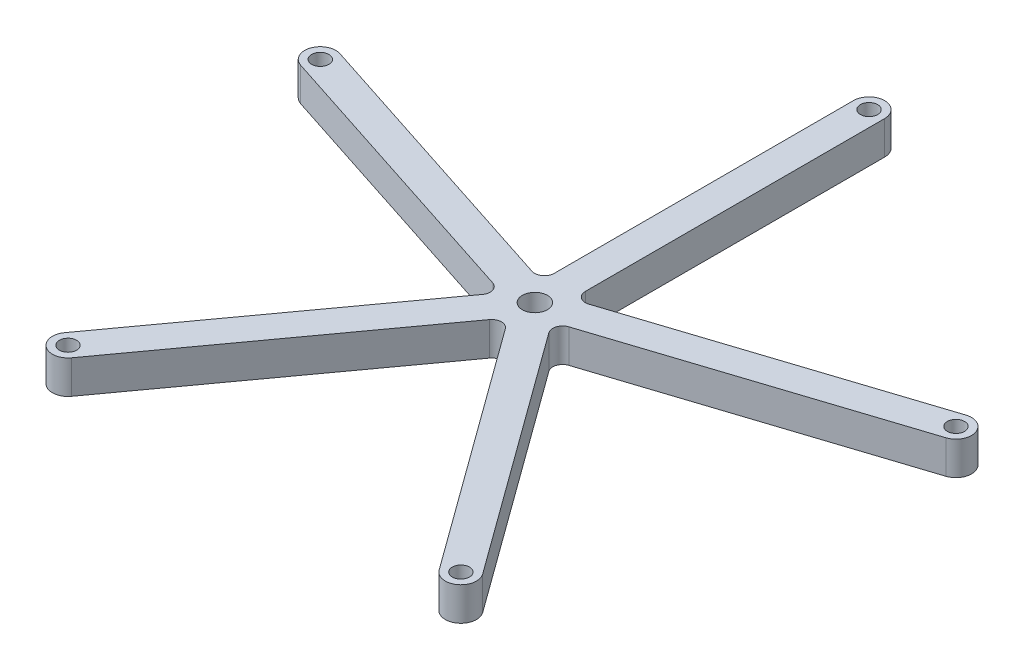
ISO-10303-21;
HEADER;
FILE_DESCRIPTION(('STEP AP214'),'2;1');
FILE_NAME('part.step','',(''),(''),'','','');
FILE_SCHEMA(('AUTOMOTIVE_DESIGN { 1 0 10303 214 1 1 1 1 }'));
ENDSEC;
DATA;
#1=APPLICATION_CONTEXT('core data for automotive mechanical design processes');
#2=APPLICATION_PROTOCOL_DEFINITION('international standard','automotive_design',2000,#1);
#3=PRODUCT_CONTEXT('',#1,'mechanical');
#4=PRODUCT('Part','Part','',(#3));
#5=PRODUCT_RELATED_PRODUCT_CATEGORY('part','',(#4));
#6=PRODUCT_DEFINITION_FORMATION('','',#4);
#7=PRODUCT_DEFINITION_CONTEXT('part definition',#1,'design');
#8=PRODUCT_DEFINITION('design','',#6,#7);
#9=PRODUCT_DEFINITION_SHAPE('','',#8);
#10=(LENGTH_UNIT() NAMED_UNIT(*) SI_UNIT(.MILLI.,.METRE.));
#11=(NAMED_UNIT(*) PLANE_ANGLE_UNIT() SI_UNIT($,.RADIAN.));
#12=(NAMED_UNIT(*) SI_UNIT($,.STERADIAN.) SOLID_ANGLE_UNIT());
#13=UNCERTAINTY_MEASURE_WITH_UNIT(LENGTH_MEASURE(1.E-05),#10,'distance_accuracy_value','');
#14=(GEOMETRIC_REPRESENTATION_CONTEXT(3) GLOBAL_UNCERTAINTY_ASSIGNED_CONTEXT((#13)) GLOBAL_UNIT_ASSIGNED_CONTEXT((#10,
#11,#12)) REPRESENTATION_CONTEXT('',''));
#15=CARTESIAN_POINT('',(0.,0.,0.));
#16=DIRECTION('',(0.,0.,1.));
#17=DIRECTION('',(1.,0.,0.));
#18=AXIS2_PLACEMENT_3D('',#15,#16,#17);
#19=CARTESIAN_POINT('',(-9.4563355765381,10.4775,5.45324363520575));
#20=CARTESIAN_POINT('',(-9.4563355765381,10.1600000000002,5.45324363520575));
#21=CARTESIAN_POINT('',(-9.45633557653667,9.84249999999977,5.45324363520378));
#22=CARTESIAN_POINT('',(-9.45633557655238,6.35000000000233,5.4532436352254));
#23=CARTESIAN_POINT('',(-9.4563355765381,3.17499999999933,5.45324363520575));
#24=CARTESIAN_POINT('',(-9.4563355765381,-0.31749999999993,5.45324363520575));
#25=CARTESIAN_POINT('',(-9.4563355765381,-0.635000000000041,5.45324363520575));
#26=CARTESIAN_POINT('',(-9.4563355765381,-0.952499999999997,5.45324363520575));
#27=CARTESIAN_POINT('',(-8.23288786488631,10.4775,3.7693123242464));
#28=CARTESIAN_POINT('',(-8.23288786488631,10.1600000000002,3.7693123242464));
#29=CARTESIAN_POINT('',(-8.23288786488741,9.84249999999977,3.76931232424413));
#30=CARTESIAN_POINT('',(-8.23288786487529,6.35000000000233,3.76931232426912));
#31=CARTESIAN_POINT('',(-8.23288786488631,3.17499999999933,3.7693123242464));
#32=CARTESIAN_POINT('',(-8.23288786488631,-0.31749999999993,3.7693123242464));
#33=CARTESIAN_POINT('',(-8.23288786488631,-0.635000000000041,3.7693123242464));
#34=CARTESIAN_POINT('',(-8.23288786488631,-0.952499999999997,3.7693123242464));
#35=CARTESIAN_POINT('',(-8.87609239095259,10.4775,1.78973234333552));
#36=CARTESIAN_POINT('',(-8.87609239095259,10.1600000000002,1.78973234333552));
#37=CARTESIAN_POINT('',(-8.8760923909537,9.84249999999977,1.78973234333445));
#38=CARTESIAN_POINT('',(-8.87609239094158,6.35000000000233,1.78973234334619));
#39=CARTESIAN_POINT('',(-8.8760923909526,3.17499999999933,1.78973234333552));
#40=CARTESIAN_POINT('',(-8.8760923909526,-0.31749999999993,1.78973234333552));
#41=CARTESIAN_POINT('',(-8.87609239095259,-0.635000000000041,1.78973234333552));
#42=CARTESIAN_POINT('',(-8.87609239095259,-0.952499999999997,1.78973234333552));
#43=CARTESIAN_POINT('',(-10.8556723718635,10.4775,1.14652781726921));
#44=CARTESIAN_POINT('',(-10.8556723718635,10.16,1.14652781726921));
#45=CARTESIAN_POINT('',(-10.8556723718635,9.84250000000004,1.14652781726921));
#46=CARTESIAN_POINT('',(-10.8556723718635,6.34999999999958,1.14652781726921));
#47=CARTESIAN_POINT('',(-10.8556723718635,3.17499999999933,1.14652781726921));
#48=CARTESIAN_POINT('',(-10.8556723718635,-0.31749999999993,1.14652781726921));
#49=CARTESIAN_POINT('',(-10.8556723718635,-0.635000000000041,1.14652781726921));
#50=CARTESIAN_POINT('',(-10.8556723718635,-0.952499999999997,1.14652781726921));
#51=(BOUNDED_SURFACE() B_SPLINE_SURFACE(3,3,((#19,#20,#21,#22,#23,#24,#25,#26),(#27,#28,#29,#30,
#31,#32,#33,#34),(#35,#36,#37,#38,#39,#40,#41,#42),(#43,#44,#45,#46,#47,#48,#49,#50)),
.UNSPECIFIED.,.F.,.F.,.F.) B_SPLINE_SURFACE_WITH_KNOTS((4,4),(4,2,2,4),(0.,1.),(-0.1,0.,1.,1.1),
.UNSPECIFIED.) GEOMETRIC_REPRESENTATION_ITEM() RATIONAL_B_SPLINE_SURFACE(((1.,1.,1.,1.,1.,1.,1.,
1.),(0.725190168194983,0.725190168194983,0.725190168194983,0.725190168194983,0.725190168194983,
0.725190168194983,0.725190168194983,0.725190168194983),(0.725190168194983,0.725190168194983,
0.725190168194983,0.725190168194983,0.725190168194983,0.725190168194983,0.725190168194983,
0.725190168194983),(1.,1.,1.,1.,1.,1.,1.,1.))) REPRESENTATION_ITEM('') SURFACE());
#52=CARTESIAN_POINT('',(-10.8556723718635,10.4775,1.14652781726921));
#53=CARTESIAN_POINT('',(-10.8556723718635,10.16,1.14652781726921));
#54=CARTESIAN_POINT('',(-10.8556723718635,9.84250000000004,1.14652781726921));
#55=CARTESIAN_POINT('',(-10.8556723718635,6.34999999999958,1.14652781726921));
#56=CARTESIAN_POINT('',(-10.8556723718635,3.17499999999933,1.14652781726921));
#57=CARTESIAN_POINT('',(-10.8556723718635,-0.31749999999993,1.14652781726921));
#58=CARTESIAN_POINT('',(-10.8556723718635,-0.635000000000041,1.14652781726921));
#59=CARTESIAN_POINT('',(-10.8556723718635,-0.952499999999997,1.14652781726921));
#60=(BOUNDED_CURVE() B_SPLINE_CURVE(3,(#52,#53,#54,#55,#56,#57,#58,#59),.UNSPECIFIED.,.F.,
.F.) B_SPLINE_CURVE_WITH_KNOTS((4,2,2,4),(-0.1,0.,1.,1.1),
.UNSPECIFIED.) CURVE() GEOMETRIC_REPRESENTATION_ITEM() RATIONAL_B_SPLINE_CURVE((1.,1.,1.,1.,1.,
1.,1.,1.)) REPRESENTATION_ITEM(''));
#61=CARTESIAN_POINT('',(-10.8556723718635,0.,1.1465278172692));
#62=VERTEX_POINT('',#61);
#63=CARTESIAN_POINT('',(-10.8556723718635,9.525,1.1465278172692));
#64=VERTEX_POINT('',#63);
#65=EDGE_CURVE('E544',#62,#64,#60,.F.);
#66=CARTESIAN_POINT('',(-10.8556723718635,0.,1.14652781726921));
#67=CARTESIAN_POINT('',(-8.8760923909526,0.,1.78973234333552));
#68=CARTESIAN_POINT('',(-8.23288786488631,0.,3.7693123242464));
#69=CARTESIAN_POINT('',(-9.4563355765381,0.,5.45324363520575));
#70=(BOUNDED_CURVE() B_SPLINE_CURVE(3,(#66,#67,#68,#69),.UNSPECIFIED.,.F.,
.F.) B_SPLINE_CURVE_WITH_KNOTS((4,4),(0.,1.),
.UNSPECIFIED.) CURVE() GEOMETRIC_REPRESENTATION_ITEM() RATIONAL_B_SPLINE_CURVE((1.,
0.725190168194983,0.725190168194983,1.)) REPRESENTATION_ITEM(''));
#71=CARTESIAN_POINT('',(-9.45633557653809,0.,5.45324363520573));
#72=VERTEX_POINT('',#71);
#73=EDGE_CURVE('E80',#62,#72,#70,.T.);
#74=CARTESIAN_POINT('',(-9.4563355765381,-0.952499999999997,5.45324363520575));
#75=CARTESIAN_POINT('',(-9.4563355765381,-0.635000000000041,5.45324363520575));
#76=CARTESIAN_POINT('',(-9.4563355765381,-0.31749999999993,5.45324363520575));
#77=CARTESIAN_POINT('',(-9.4563355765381,3.17499999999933,5.45324363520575));
#78=CARTESIAN_POINT('',(-9.45633557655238,6.35000000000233,5.4532436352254));
#79=CARTESIAN_POINT('',(-9.45633557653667,9.84249999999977,5.45324363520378));
#80=CARTESIAN_POINT('',(-9.4563355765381,10.1600000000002,5.45324363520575));
#81=CARTESIAN_POINT('',(-9.4563355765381,10.4775,5.45324363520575));
#82=(BOUNDED_CURVE() B_SPLINE_CURVE(3,(#74,#75,#76,#77,#78,#79,#80,#81),.UNSPECIFIED.,.F.,
.F.) B_SPLINE_CURVE_WITH_KNOTS((4,2,2,4),(-0.1,0.,1.,1.1),
.UNSPECIFIED.) CURVE() GEOMETRIC_REPRESENTATION_ITEM() RATIONAL_B_SPLINE_CURVE((1.,1.,1.,1.,1.,
1.,1.,1.)) REPRESENTATION_ITEM(''));
#83=CARTESIAN_POINT('',(-9.45633557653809,9.525,5.45324363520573));
#84=VERTEX_POINT('',#83);
#85=EDGE_CURVE('E552',#84,#72,#82,.F.);
#86=CARTESIAN_POINT('',(-9.4563355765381,9.525,5.45324363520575));
#87=CARTESIAN_POINT('',(-8.23288786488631,9.525,3.7693123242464));
#88=CARTESIAN_POINT('',(-8.8760923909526,9.525,1.78973234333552));
#89=CARTESIAN_POINT('',(-10.8556723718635,9.525,1.14652781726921));
#90=(BOUNDED_CURVE() B_SPLINE_CURVE(3,(#86,#87,#88,#89),.UNSPECIFIED.,.F.,
.F.) B_SPLINE_CURVE_WITH_KNOTS((4,4),(0.,1.),
.UNSPECIFIED.) CURVE() GEOMETRIC_REPRESENTATION_ITEM() RATIONAL_B_SPLINE_CURVE((1.,
0.725190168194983,0.725190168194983,1.)) REPRESENTATION_ITEM(''));
#91=EDGE_CURVE('E13',#84,#64,#90,.T.);
#92=ORIENTED_EDGE('',*,*,#65,.F.);
#93=ORIENTED_EDGE('',*,*,#73,.T.);
#94=ORIENTED_EDGE('',*,*,#85,.F.);
#95=ORIENTED_EDGE('',*,*,#91,.T.);
#96=EDGE_LOOP('',(#92,#93,#94,#95));
#97=FACE_BOUND('',#96,.T.);
#98=ADVANCED_FACE('F65',(#97),#51,.T.);
#99=CARTESIAN_POINT('',(-8.10851129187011,10.4775,-7.30836461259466));
#100=CARTESIAN_POINT('',(-8.10851129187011,10.1600000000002,-7.30836461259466));
#101=CARTESIAN_POINT('',(-8.10851129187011,9.84249999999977,-7.30836461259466));
#102=CARTESIAN_POINT('',(-8.10851129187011,6.35000000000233,-7.30836461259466));
#103=CARTESIAN_POINT('',(-8.10851129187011,3.17499999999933,-7.30836461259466));
#104=CARTESIAN_POINT('',(-8.10851129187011,-0.31749999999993,-7.30836461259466));
#105=CARTESIAN_POINT('',(-8.10851129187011,-0.635000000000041,-7.30836461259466));
#106=CARTESIAN_POINT('',(-8.10851129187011,-0.952499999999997,-7.30836461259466));
#107=CARTESIAN_POINT('',(-6.1289313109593,10.4775,-6.66516008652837));
#108=CARTESIAN_POINT('',(-6.1289313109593,10.1600000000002,-6.66516008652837));
#109=CARTESIAN_POINT('',(-6.1289313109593,9.84249999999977,-6.66516008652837));
#110=CARTESIAN_POINT('',(-6.1289313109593,6.35000000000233,-6.66516008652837));
#111=CARTESIAN_POINT('',(-6.1289313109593,3.17499999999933,-6.66516008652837));
#112=CARTESIAN_POINT('',(-6.1289313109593,-0.31749999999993,-6.66516008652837));
#113=CARTESIAN_POINT('',(-6.1289313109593,-0.635000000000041,-6.66516008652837));
#114=CARTESIAN_POINT('',(-6.1289313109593,-0.952499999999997,-6.66516008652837));
#115=CARTESIAN_POINT('',(-4.445,10.4775,-7.88860779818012));
#116=CARTESIAN_POINT('',(-4.445,10.1600000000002,-7.88860779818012));
#117=CARTESIAN_POINT('',(-4.445,9.84249999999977,-7.88860779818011));
#118=CARTESIAN_POINT('',(-4.445,6.35000000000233,-7.88860779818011));
#119=CARTESIAN_POINT('',(-4.445,3.17499999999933,-7.88860779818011));
#120=CARTESIAN_POINT('',(-4.445,-0.31749999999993,-7.88860779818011));
#121=CARTESIAN_POINT('',(-4.445,-0.635000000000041,-7.88860779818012));
#122=CARTESIAN_POINT('',(-4.445,-0.952499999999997,-7.88860779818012));
#123=CARTESIAN_POINT('',(-4.445,10.4775,-9.97006136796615));
#124=CARTESIAN_POINT('',(-4.445,10.1600000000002,-9.97006136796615));
#125=CARTESIAN_POINT('',(-4.445,9.84249999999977,-9.97006136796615));
#126=CARTESIAN_POINT('',(-4.445,6.35000000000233,-9.97006136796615));
#127=CARTESIAN_POINT('',(-4.445,3.17499999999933,-9.97006136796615));
#128=CARTESIAN_POINT('',(-4.445,-0.31749999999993,-9.97006136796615));
#129=CARTESIAN_POINT('',(-4.445,-0.635000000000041,-9.97006136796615));
#130=CARTESIAN_POINT('',(-4.445,-0.952499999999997,-9.97006136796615));
#131=(BOUNDED_SURFACE() B_SPLINE_SURFACE(3,3,((#99,#100,#101,#102,#103,#104,#105,#106),(#107,
#108,#109,#110,#111,#112,#113,#114),(#115,#116,#117,#118,#119,#120,#121,#122),(#123,#124,#125,
#126,#127,#128,#129,#130)),.UNSPECIFIED.,.F.,.F.,.F.) B_SPLINE_SURFACE_WITH_KNOTS((4,4),(4,2,2,
4),(0.,1.),(-0.1,0.,1.,1.1),
.UNSPECIFIED.) GEOMETRIC_REPRESENTATION_ITEM() RATIONAL_B_SPLINE_SURFACE(((1.,1.,1.,1.,1.,1.,1.,
1.),(0.72519016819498,0.72519016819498,0.72519016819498,0.72519016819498,0.72519016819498,
0.72519016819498,0.72519016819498,0.72519016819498),(0.72519016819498,0.72519016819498,
0.72519016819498,0.72519016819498,0.72519016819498,0.72519016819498,0.72519016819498,
0.72519016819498),(1.,1.,1.,1.,1.,1.,1.,1.))) REPRESENTATION_ITEM('') SURFACE());
#132=CARTESIAN_POINT('',(-4.445,10.4775,-9.97006136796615));
#133=CARTESIAN_POINT('',(-4.445,10.1600000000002,-9.97006136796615));
#134=CARTESIAN_POINT('',(-4.445,9.84249999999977,-9.97006136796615));
#135=CARTESIAN_POINT('',(-4.445,6.35000000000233,-9.97006136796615));
#136=CARTESIAN_POINT('',(-4.445,3.17499999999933,-9.97006136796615));
#137=CARTESIAN_POINT('',(-4.445,-0.31749999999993,-9.97006136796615));
#138=CARTESIAN_POINT('',(-4.445,-0.635000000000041,-9.97006136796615));
#139=CARTESIAN_POINT('',(-4.445,-0.952499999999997,-9.97006136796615));
#140=(BOUNDED_CURVE() B_SPLINE_CURVE(3,(#132,#133,#134,#135,#136,#137,#138,#139),.UNSPECIFIED.,
.F.,.F.) B_SPLINE_CURVE_WITH_KNOTS((4,2,2,4),(-0.1,0.,1.,1.1),
.UNSPECIFIED.) CURVE() GEOMETRIC_REPRESENTATION_ITEM() RATIONAL_B_SPLINE_CURVE((1.,1.,1.,1.,1.,
1.,1.,1.)) REPRESENTATION_ITEM(''));
#141=CARTESIAN_POINT('',(-4.445,0.,-9.97006136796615));
#142=VERTEX_POINT('',#141);
#143=CARTESIAN_POINT('',(-4.445,9.525,-9.97006136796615));
#144=VERTEX_POINT('',#143);
#145=EDGE_CURVE('E249',#142,#144,#140,.F.);
#146=CARTESIAN_POINT('',(-4.445,0.,-9.97006136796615));
#147=CARTESIAN_POINT('',(-4.445,0.,-7.88860779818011));
#148=CARTESIAN_POINT('',(-6.1289313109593,0.,-6.66516008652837));
#149=CARTESIAN_POINT('',(-8.10851129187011,0.,-7.30836461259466));
#150=(BOUNDED_CURVE() B_SPLINE_CURVE(3,(#146,#147,#148,#149),.UNSPECIFIED.,.F.,
.F.) B_SPLINE_CURVE_WITH_KNOTS((4,4),(0.,1.),
.UNSPECIFIED.) CURVE() GEOMETRIC_REPRESENTATION_ITEM() RATIONAL_B_SPLINE_CURVE((1.,
0.72519016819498,0.72519016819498,1.)) REPRESENTATION_ITEM(''));
#151=CARTESIAN_POINT('',(-8.10851129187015,0.,-7.30836461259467));
#152=VERTEX_POINT('',#151);
#153=EDGE_CURVE('E721',#142,#152,#150,.T.);
#154=CARTESIAN_POINT('',(-8.10851129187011,-0.952499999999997,-7.30836461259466));
#155=CARTESIAN_POINT('',(-8.10851129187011,-0.635000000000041,-7.30836461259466));
#156=CARTESIAN_POINT('',(-8.10851129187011,-0.31749999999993,-7.30836461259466));
#157=CARTESIAN_POINT('',(-8.10851129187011,3.17499999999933,-7.30836461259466));
#158=CARTESIAN_POINT('',(-8.10851129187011,6.35000000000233,-7.30836461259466));
#159=CARTESIAN_POINT('',(-8.10851129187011,9.84249999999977,-7.30836461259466));
#160=CARTESIAN_POINT('',(-8.10851129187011,10.1600000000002,-7.30836461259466));
#161=CARTESIAN_POINT('',(-8.10851129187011,10.4775,-7.30836461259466));
#162=(BOUNDED_CURVE() B_SPLINE_CURVE(3,(#154,#155,#156,#157,#158,#159,#160,#161),.UNSPECIFIED.,
.F.,.F.) B_SPLINE_CURVE_WITH_KNOTS((4,2,2,4),(-0.1,0.,1.,1.1),
.UNSPECIFIED.) CURVE() GEOMETRIC_REPRESENTATION_ITEM() RATIONAL_B_SPLINE_CURVE((1.,1.,1.,1.,1.,
1.,1.,1.)) REPRESENTATION_ITEM(''));
#163=CARTESIAN_POINT('',(-8.10851129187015,9.525,-7.30836461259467));
#164=VERTEX_POINT('',#163);
#165=EDGE_CURVE('E722',#164,#152,#162,.F.);
#166=CARTESIAN_POINT('',(-8.10851129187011,9.525,-7.30836461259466));
#167=CARTESIAN_POINT('',(-6.1289313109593,9.525,-6.66516008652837));
#168=CARTESIAN_POINT('',(-4.445,9.525,-7.88860779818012));
#169=CARTESIAN_POINT('',(-4.445,9.525,-9.97006136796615));
#170=(BOUNDED_CURVE() B_SPLINE_CURVE(3,(#166,#167,#168,#169),.UNSPECIFIED.,.F.,
.F.) B_SPLINE_CURVE_WITH_KNOTS((4,4),(0.,1.),
.UNSPECIFIED.) CURVE() GEOMETRIC_REPRESENTATION_ITEM() RATIONAL_B_SPLINE_CURVE((1.,
0.72519016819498,0.72519016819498,1.)) REPRESENTATION_ITEM(''));
#171=EDGE_CURVE('E553',#164,#144,#170,.T.);
#172=ORIENTED_EDGE('',*,*,#145,.F.);
#173=ORIENTED_EDGE('',*,*,#153,.T.);
#174=ORIENTED_EDGE('',*,*,#165,.F.);
#175=ORIENTED_EDGE('',*,*,#171,.T.);
#176=EDGE_LOOP('',(#172,#173,#174,#175));
#177=FACE_BOUND('',#176,.T.);
#178=ADVANCED_FACE('F537',(#177),#131,.T.);
#179=CARTESIAN_POINT('',(4.445,10.4775,-9.97006136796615));
#180=CARTESIAN_POINT('',(4.445,10.1600000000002,-9.97006136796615));
#181=CARTESIAN_POINT('',(4.445,9.84249999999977,-9.97006136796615));
#182=CARTESIAN_POINT('',(4.445,6.35000000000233,-9.97006136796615));
#183=CARTESIAN_POINT('',(4.445,3.17499999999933,-9.97006136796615));
#184=CARTESIAN_POINT('',(4.445,-0.31749999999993,-9.97006136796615));
#185=CARTESIAN_POINT('',(4.445,-0.635000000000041,-9.97006136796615));
#186=CARTESIAN_POINT('',(4.445,-0.952499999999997,-9.97006136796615));
#187=CARTESIAN_POINT('',(4.445,10.4775,-7.88860779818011));
#188=CARTESIAN_POINT('',(4.445,10.1600000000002,-7.88860779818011));
#189=CARTESIAN_POINT('',(4.445,9.84249999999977,-7.88860779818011));
#190=CARTESIAN_POINT('',(4.445,6.35000000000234,-7.88860779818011));
#191=CARTESIAN_POINT('',(4.445,3.17499999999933,-7.88860779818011));
#192=CARTESIAN_POINT('',(4.445,-0.31749999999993,-7.88860779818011));
#193=CARTESIAN_POINT('',(4.445,-0.635000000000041,-7.88860779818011));
#194=CARTESIAN_POINT('',(4.445,-0.952499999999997,-7.88860779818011));
#195=CARTESIAN_POINT('',(6.1289313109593,10.4775,-6.66516008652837));
#196=CARTESIAN_POINT('',(6.1289313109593,10.1600000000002,-6.66516008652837));
#197=CARTESIAN_POINT('',(6.1289313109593,9.84249999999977,-6.66516008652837));
#198=CARTESIAN_POINT('',(6.1289313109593,6.35000000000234,-6.66516008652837));
#199=CARTESIAN_POINT('',(6.1289313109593,3.17499999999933,-6.66516008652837));
#200=CARTESIAN_POINT('',(6.1289313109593,-0.31749999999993,-6.66516008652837));
#201=CARTESIAN_POINT('',(6.1289313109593,-0.635000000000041,-6.66516008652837));
#202=CARTESIAN_POINT('',(6.1289313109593,-0.952499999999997,-6.66516008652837));
#203=CARTESIAN_POINT('',(8.10851129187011,10.4775,-7.30836461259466));
#204=CARTESIAN_POINT('',(8.10851129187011,10.1600000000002,-7.30836461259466));
#205=CARTESIAN_POINT('',(8.10851129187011,9.84249999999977,-7.30836461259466));
#206=CARTESIAN_POINT('',(8.10851129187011,6.35000000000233,-7.30836461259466));
#207=CARTESIAN_POINT('',(8.10851129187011,3.17499999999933,-7.30836461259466));
#208=CARTESIAN_POINT('',(8.10851129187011,-0.31749999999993,-7.30836461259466));
#209=CARTESIAN_POINT('',(8.10851129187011,-0.635000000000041,-7.30836461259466));
#210=CARTESIAN_POINT('',(8.10851129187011,-0.952499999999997,-7.30836461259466));
#211=(BOUNDED_SURFACE() B_SPLINE_SURFACE(3,3,((#179,#180,#181,#182,#183,#184,#185,#186),(#187,
#188,#189,#190,#191,#192,#193,#194),(#195,#196,#197,#198,#199,#200,#201,#202),(#203,#204,#205,
#206,#207,#208,#209,#210)),.UNSPECIFIED.,.F.,.F.,.F.) B_SPLINE_SURFACE_WITH_KNOTS((4,4),(4,2,2,
4),(0.,1.),(-0.1,0.,1.,1.1),
.UNSPECIFIED.) GEOMETRIC_REPRESENTATION_ITEM() RATIONAL_B_SPLINE_SURFACE(((1.,1.,1.,1.,1.,1.,1.,
1.),(0.72519016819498,0.72519016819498,0.72519016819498,0.72519016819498,0.72519016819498,
0.72519016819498,0.72519016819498,0.72519016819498),(0.72519016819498,0.72519016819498,
0.72519016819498,0.72519016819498,0.72519016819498,0.72519016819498,0.72519016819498,
0.72519016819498),(1.,1.,1.,1.,1.,1.,1.,1.))) REPRESENTATION_ITEM('') SURFACE());
#212=CARTESIAN_POINT('',(8.10851129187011,10.4775,-7.30836461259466));
#213=CARTESIAN_POINT('',(8.10851129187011,10.1600000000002,-7.30836461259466));
#214=CARTESIAN_POINT('',(8.10851129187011,9.84249999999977,-7.30836461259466));
#215=CARTESIAN_POINT('',(8.10851129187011,6.35000000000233,-7.30836461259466));
#216=CARTESIAN_POINT('',(8.10851129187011,3.17499999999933,-7.30836461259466));
#217=CARTESIAN_POINT('',(8.10851129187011,-0.31749999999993,-7.30836461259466));
#218=CARTESIAN_POINT('',(8.10851129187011,-0.635000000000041,-7.30836461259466));
#219=CARTESIAN_POINT('',(8.10851129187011,-0.952499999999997,-7.30836461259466));
#220=(BOUNDED_CURVE() B_SPLINE_CURVE(3,(#212,#213,#214,#215,#216,#217,#218,#219),.UNSPECIFIED.,
.F.,.F.) B_SPLINE_CURVE_WITH_KNOTS((4,2,2,4),(-0.1,0.,1.,1.1),
.UNSPECIFIED.) CURVE() GEOMETRIC_REPRESENTATION_ITEM() RATIONAL_B_SPLINE_CURVE((1.,1.,1.,1.,1.,
1.,1.,1.)) REPRESENTATION_ITEM(''));
#221=CARTESIAN_POINT('',(8.10851129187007,0.,-7.30836461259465));
#222=VERTEX_POINT('',#221);
#223=CARTESIAN_POINT('',(8.10851129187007,9.525,-7.30836461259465));
#224=VERTEX_POINT('',#223);
#225=EDGE_CURVE('E752',#222,#224,#220,.F.);
#226=CARTESIAN_POINT('',(8.10851129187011,0.,-7.30836461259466));
#227=CARTESIAN_POINT('',(6.1289313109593,0.,-6.66516008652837));
#228=CARTESIAN_POINT('',(4.445,0.,-7.88860779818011));
#229=CARTESIAN_POINT('',(4.445,0.,-9.97006136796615));
#230=(BOUNDED_CURVE() B_SPLINE_CURVE(3,(#226,#227,#228,#229),.UNSPECIFIED.,.F.,
.F.) B_SPLINE_CURVE_WITH_KNOTS((4,4),(0.,1.),
.UNSPECIFIED.) CURVE() GEOMETRIC_REPRESENTATION_ITEM() RATIONAL_B_SPLINE_CURVE((1.,
0.72519016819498,0.72519016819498,1.)) REPRESENTATION_ITEM(''));
#231=CARTESIAN_POINT('',(4.445,0.,-9.97006136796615));
#232=VERTEX_POINT('',#231);
#233=EDGE_CURVE('E748',#222,#232,#230,.T.);
#234=CARTESIAN_POINT('',(4.445,-0.952499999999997,-9.97006136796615));
#235=CARTESIAN_POINT('',(4.445,-0.635000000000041,-9.97006136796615));
#236=CARTESIAN_POINT('',(4.445,-0.31749999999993,-9.97006136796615));
#237=CARTESIAN_POINT('',(4.445,3.17499999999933,-9.97006136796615));
#238=CARTESIAN_POINT('',(4.445,6.35000000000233,-9.97006136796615));
#239=CARTESIAN_POINT('',(4.445,9.84249999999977,-9.97006136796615));
#240=CARTESIAN_POINT('',(4.445,10.1600000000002,-9.97006136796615));
#241=CARTESIAN_POINT('',(4.445,10.4775,-9.97006136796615));
#242=(BOUNDED_CURVE() B_SPLINE_CURVE(3,(#234,#235,#236,#237,#238,#239,#240,#241),.UNSPECIFIED.,
.F.,.F.) B_SPLINE_CURVE_WITH_KNOTS((4,2,2,4),(-0.1,0.,1.,1.1),
.UNSPECIFIED.) CURVE() GEOMETRIC_REPRESENTATION_ITEM() RATIONAL_B_SPLINE_CURVE((1.,1.,1.,1.,1.,
1.,1.,1.)) REPRESENTATION_ITEM(''));
#243=CARTESIAN_POINT('',(4.445,9.525,-9.97006136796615));
#244=VERTEX_POINT('',#243);
#245=EDGE_CURVE('E500',#244,#232,#242,.F.);
#246=CARTESIAN_POINT('',(4.445,9.525,-9.97006136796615));
#247=CARTESIAN_POINT('',(4.445,9.525,-7.88860779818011));
#248=CARTESIAN_POINT('',(6.1289313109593,9.525,-6.66516008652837));
#249=CARTESIAN_POINT('',(8.10851129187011,9.525,-7.30836461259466));
#250=(BOUNDED_CURVE() B_SPLINE_CURVE(3,(#246,#247,#248,#249),.UNSPECIFIED.,.F.,
.F.) B_SPLINE_CURVE_WITH_KNOTS((4,4),(0.,1.),
.UNSPECIFIED.) CURVE() GEOMETRIC_REPRESENTATION_ITEM() RATIONAL_B_SPLINE_CURVE((1.,
0.72519016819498,0.72519016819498,1.)) REPRESENTATION_ITEM(''));
#251=EDGE_CURVE('E755',#244,#224,#250,.T.);
#252=ORIENTED_EDGE('',*,*,#225,.F.);
#253=ORIENTED_EDGE('',*,*,#233,.T.);
#254=ORIENTED_EDGE('',*,*,#245,.F.);
#255=ORIENTED_EDGE('',*,*,#251,.T.);
#256=EDGE_LOOP('',(#252,#253,#254,#255));
#257=FACE_BOUND('',#256,.T.);
#258=ADVANCED_FACE('F541',(#257),#211,.T.);
#259=CARTESIAN_POINT('',(10.8556723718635,10.4775,1.14652781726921));
#260=CARTESIAN_POINT('',(10.8556723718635,10.16,1.14652781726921));
#261=CARTESIAN_POINT('',(10.8556723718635,9.84250000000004,1.14652781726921));
#262=CARTESIAN_POINT('',(10.8556723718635,6.34999999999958,1.14652781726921));
#263=CARTESIAN_POINT('',(10.8556723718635,3.17499999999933,1.14652781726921));
#264=CARTESIAN_POINT('',(10.8556723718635,-0.31749999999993,1.14652781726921));
#265=CARTESIAN_POINT('',(10.8556723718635,-0.635000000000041,1.14652781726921));
#266=CARTESIAN_POINT('',(10.8556723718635,-0.952499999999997,1.14652781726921));
#267=CARTESIAN_POINT('',(8.87609239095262,10.4775,1.78973234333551));
#268=CARTESIAN_POINT('',(8.87609239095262,10.1600000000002,1.78973234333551));
#269=CARTESIAN_POINT('',(8.87609239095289,9.84249999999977,1.78973234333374));
#270=CARTESIAN_POINT('',(8.87609239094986,6.35000000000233,1.78973234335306));
#271=CARTESIAN_POINT('',(8.87609239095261,3.17499999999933,1.78973234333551));
#272=CARTESIAN_POINT('',(8.87609239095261,-0.31749999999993,1.78973234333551));
#273=CARTESIAN_POINT('',(8.87609239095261,-0.635000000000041,1.78973234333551));
#274=CARTESIAN_POINT('',(8.87609239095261,-0.952499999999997,1.78973234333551));
#275=CARTESIAN_POINT('',(8.23288786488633,10.4775,3.76931232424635));
#276=CARTESIAN_POINT('',(8.23288786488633,10.1600000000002,3.76931232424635));
#277=CARTESIAN_POINT('',(8.23288786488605,9.84249999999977,3.76931232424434));
#278=CARTESIAN_POINT('',(8.23288786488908,6.35000000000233,3.76931232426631));
#279=CARTESIAN_POINT('',(8.23288786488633,3.17499999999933,3.76931232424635));
#280=CARTESIAN_POINT('',(8.23288786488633,-0.31749999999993,3.76931232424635));
#281=CARTESIAN_POINT('',(8.23288786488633,-0.635000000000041,3.76931232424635));
#282=CARTESIAN_POINT('',(8.23288786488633,-0.952499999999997,3.76931232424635));
#283=CARTESIAN_POINT('',(9.4563355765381,10.4775,5.45324363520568));
#284=CARTESIAN_POINT('',(9.4563355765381,10.1600000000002,5.45324363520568));
#285=CARTESIAN_POINT('',(9.45633557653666,9.84249999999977,5.4532436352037));
#286=CARTESIAN_POINT('',(9.45633557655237,6.35000000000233,5.45324363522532));
#287=CARTESIAN_POINT('',(9.4563355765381,3.17499999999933,5.45324363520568));
#288=CARTESIAN_POINT('',(9.4563355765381,-0.31749999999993,5.45324363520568));
#289=CARTESIAN_POINT('',(9.4563355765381,-0.635000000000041,5.45324363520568));
#290=CARTESIAN_POINT('',(9.4563355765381,-0.952499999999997,5.45324363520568));
#291=(BOUNDED_SURFACE() B_SPLINE_SURFACE(3,3,((#259,#260,#261,#262,#263,#264,#265,#266),(#267,
#268,#269,#270,#271,#272,#273,#274),(#275,#276,#277,#278,#279,#280,#281,#282),(#283,#284,#285,
#286,#287,#288,#289,#290)),.UNSPECIFIED.,.F.,.F.,.F.) B_SPLINE_SURFACE_WITH_KNOTS((4,4),(4,2,2,
4),(0.,1.),(-0.1,0.,1.,1.1),
.UNSPECIFIED.) GEOMETRIC_REPRESENTATION_ITEM() RATIONAL_B_SPLINE_SURFACE(((1.,1.,1.,1.,1.,1.,1.,
1.),(0.725190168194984,0.725190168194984,0.725190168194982,0.725190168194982,0.725190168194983,
0.725190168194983,0.725190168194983,0.725190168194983),(0.725190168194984,0.725190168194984,
0.725190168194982,0.725190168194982,0.725190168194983,0.725190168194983,0.725190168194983,
0.725190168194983),(1.,1.,1.,1.,1.,1.,1.,1.))) REPRESENTATION_ITEM('') SURFACE());
#292=CARTESIAN_POINT('',(9.4563355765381,10.4775,5.45324363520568));
#293=CARTESIAN_POINT('',(9.4563355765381,10.1600000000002,5.45324363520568));
#294=CARTESIAN_POINT('',(9.45633557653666,9.84249999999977,5.4532436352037));
#295=CARTESIAN_POINT('',(9.45633557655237,6.35000000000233,5.45324363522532));
#296=CARTESIAN_POINT('',(9.4563355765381,3.17499999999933,5.45324363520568));
#297=CARTESIAN_POINT('',(9.4563355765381,-0.31749999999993,5.45324363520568));
#298=CARTESIAN_POINT('',(9.4563355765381,-0.635000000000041,5.45324363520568));
#299=CARTESIAN_POINT('',(9.4563355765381,-0.952499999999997,5.45324363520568));
#300=(BOUNDED_CURVE() B_SPLINE_CURVE(3,(#292,#293,#294,#295,#296,#297,#298,#299),.UNSPECIFIED.,
.F.,.F.) B_SPLINE_CURVE_WITH_KNOTS((4,2,2,4),(-0.1,0.,1.,1.1),
.UNSPECIFIED.) CURVE() GEOMETRIC_REPRESENTATION_ITEM() RATIONAL_B_SPLINE_CURVE((1.,1.,1.,1.,1.,
1.,1.,1.)) REPRESENTATION_ITEM(''));
#301=CARTESIAN_POINT('',(9.45633557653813,0.,5.45324363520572));
#302=VERTEX_POINT('',#301);
#303=CARTESIAN_POINT('',(9.45633557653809,9.525,5.45324363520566));
#304=VERTEX_POINT('',#303);
#305=EDGE_CURVE('E337',#302,#304,#300,.F.);
#306=CARTESIAN_POINT('',(9.4563355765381,0.,5.45324363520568));
#307=CARTESIAN_POINT('',(8.23288786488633,0.,3.76931232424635));
#308=CARTESIAN_POINT('',(8.87609239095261,0.,1.78973234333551));
#309=CARTESIAN_POINT('',(10.8556723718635,0.,1.14652781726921));
#310=(BOUNDED_CURVE() B_SPLINE_CURVE(3,(#306,#307,#308,#309),.UNSPECIFIED.,.F.,
.F.) B_SPLINE_CURVE_WITH_KNOTS((4,4),(0.,1.),
.UNSPECIFIED.) CURVE() GEOMETRIC_REPRESENTATION_ITEM() RATIONAL_B_SPLINE_CURVE((1.,
0.725190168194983,0.725190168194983,1.)) REPRESENTATION_ITEM(''));
#311=CARTESIAN_POINT('',(10.8556723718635,0.,1.14652781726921));
#312=VERTEX_POINT('',#311);
#313=EDGE_CURVE('E1040',#302,#312,#310,.T.);
#314=CARTESIAN_POINT('',(10.8556723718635,-0.952499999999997,1.14652781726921));
#315=CARTESIAN_POINT('',(10.8556723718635,-0.635000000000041,1.14652781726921));
#316=CARTESIAN_POINT('',(10.8556723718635,-0.31749999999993,1.14652781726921));
#317=CARTESIAN_POINT('',(10.8556723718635,3.17499999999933,1.14652781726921));
#318=CARTESIAN_POINT('',(10.8556723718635,6.34999999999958,1.14652781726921));
#319=CARTESIAN_POINT('',(10.8556723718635,9.84250000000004,1.14652781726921));
#320=CARTESIAN_POINT('',(10.8556723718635,10.16,1.14652781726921));
#321=CARTESIAN_POINT('',(10.8556723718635,10.4775,1.14652781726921));
#322=(BOUNDED_CURVE() B_SPLINE_CURVE(3,(#314,#315,#316,#317,#318,#319,#320,#321),.UNSPECIFIED.,
.F.,.F.) B_SPLINE_CURVE_WITH_KNOTS((4,2,2,4),(-0.1,0.,1.,1.1),
.UNSPECIFIED.) CURVE() GEOMETRIC_REPRESENTATION_ITEM() RATIONAL_B_SPLINE_CURVE((1.,1.,1.,1.,1.,
1.,1.,1.)) REPRESENTATION_ITEM(''));
#323=CARTESIAN_POINT('',(10.8556723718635,9.525,1.14652781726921));
#324=VERTEX_POINT('',#323);
#325=EDGE_CURVE('E1045',#324,#312,#322,.F.);
#326=CARTESIAN_POINT('',(10.8556723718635,9.525,1.14652781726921));
#327=CARTESIAN_POINT('',(8.87609239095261,9.525,1.7897323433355));
#328=CARTESIAN_POINT('',(8.23288786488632,9.525,3.76931232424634));
#329=CARTESIAN_POINT('',(9.45633557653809,9.525,5.45324363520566));
#330=(BOUNDED_CURVE() B_SPLINE_CURVE(3,(#326,#327,#328,#329),.UNSPECIFIED.,.F.,
.F.) B_SPLINE_CURVE_WITH_KNOTS((4,4),(0.,1.),
.UNSPECIFIED.) CURVE() GEOMETRIC_REPRESENTATION_ITEM() RATIONAL_B_SPLINE_CURVE((1.,
0.725190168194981,0.725190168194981,1.)) REPRESENTATION_ITEM(''));
#331=EDGE_CURVE('E753',#324,#304,#330,.T.);
#332=ORIENTED_EDGE('',*,*,#305,.F.);
#333=ORIENTED_EDGE('',*,*,#313,.T.);
#334=ORIENTED_EDGE('',*,*,#325,.F.);
#335=ORIENTED_EDGE('',*,*,#331,.T.);
#336=EDGE_LOOP('',(#332,#333,#334,#335));
#337=FACE_BOUND('',#336,.T.);
#338=ADVANCED_FACE('F401',(#337),#291,.T.);
#339=CARTESIAN_POINT('',(2.26417449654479,10.4775,10.6786545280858));
#340=CARTESIAN_POINT('',(2.26417449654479,10.1600000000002,10.6786545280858));
#341=CARTESIAN_POINT('',(2.26417449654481,9.84249999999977,10.6786545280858));
#342=CARTESIAN_POINT('',(2.26417449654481,6.35000000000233,10.6786545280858));
#343=CARTESIAN_POINT('',(2.26417449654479,3.17499999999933,10.6786545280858));
#344=CARTESIAN_POINT('',(2.26417449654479,-0.31749999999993,10.6786545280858));
#345=CARTESIAN_POINT('',(2.26417449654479,-0.635000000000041,10.6786545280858));
#346=CARTESIAN_POINT('',(2.26417449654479,-0.952499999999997,10.6786545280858));
#347=CARTESIAN_POINT('',(1.04072678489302,10.4775,8.99472321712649));
#348=CARTESIAN_POINT('',(1.04072678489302,10.1600000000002,8.99472321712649));
#349=CARTESIAN_POINT('',(1.04072678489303,9.84249999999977,8.99472321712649));
#350=CARTESIAN_POINT('',(1.04072678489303,6.35000000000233,8.99472321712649));
#351=CARTESIAN_POINT('',(1.04072678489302,3.17499999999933,8.99472321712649));
#352=CARTESIAN_POINT('',(1.04072678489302,-0.31749999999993,8.99472321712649));
#353=CARTESIAN_POINT('',(1.04072678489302,-0.635000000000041,8.99472321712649));
#354=CARTESIAN_POINT('',(1.04072678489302,-0.952499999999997,8.99472321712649));
#355=CARTESIAN_POINT('',(-1.04072678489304,10.4775,8.99472321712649));
#356=CARTESIAN_POINT('',(-1.04072678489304,10.1600000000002,8.99472321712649));
#357=CARTESIAN_POINT('',(-1.04072678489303,9.84249999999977,8.99472321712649));
#358=CARTESIAN_POINT('',(-1.04072678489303,6.35000000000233,8.99472321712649));
#359=CARTESIAN_POINT('',(-1.04072678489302,3.17499999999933,8.99472321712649));
#360=CARTESIAN_POINT('',(-1.04072678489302,-0.31749999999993,8.99472321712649));
#361=CARTESIAN_POINT('',(-1.04072678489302,-0.635000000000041,8.99472321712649));
#362=CARTESIAN_POINT('',(-1.04072678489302,-0.952499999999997,8.99472321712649));
#363=CARTESIAN_POINT('',(-2.26417449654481,10.4775,10.6786545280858));
#364=CARTESIAN_POINT('',(-2.26417449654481,10.1600000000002,10.6786545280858));
#365=CARTESIAN_POINT('',(-2.26417449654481,9.84249999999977,10.6786545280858));
#366=CARTESIAN_POINT('',(-2.26417449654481,6.35000000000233,10.6786545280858));
#367=CARTESIAN_POINT('',(-2.26417449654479,3.17499999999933,10.6786545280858));
#368=CARTESIAN_POINT('',(-2.26417449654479,-0.31749999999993,10.6786545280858));
#369=CARTESIAN_POINT('',(-2.26417449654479,-0.635000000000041,10.6786545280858));
#370=CARTESIAN_POINT('',(-2.26417449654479,-0.952499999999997,10.6786545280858));
#371=(BOUNDED_SURFACE() B_SPLINE_SURFACE(3,3,((#339,#340,#341,#342,#343,#344,#345,#346),(#347,
#348,#349,#350,#351,#352,#353,#354),(#355,#356,#357,#358,#359,#360,#361,#362),(#363,#364,#365,
#366,#367,#368,#369,#370)),.UNSPECIFIED.,.F.,.F.,.F.) B_SPLINE_SURFACE_WITH_KNOTS((4,4),(4,2,2,
4),(0.,1.),(-0.1,0.,1.,1.1),
.UNSPECIFIED.) GEOMETRIC_REPRESENTATION_ITEM() RATIONAL_B_SPLINE_SURFACE(((1.,1.,1.,1.,1.,1.,1.,
1.),(0.725190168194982,0.725190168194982,0.725190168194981,0.725190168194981,0.725190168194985,
0.725190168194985,0.725190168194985,0.725190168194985),(0.725190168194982,0.725190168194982,
0.725190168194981,0.725190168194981,0.725190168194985,0.725190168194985,0.725190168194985,
0.725190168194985),(1.,1.,1.,1.,1.,1.,1.,1.))) REPRESENTATION_ITEM('') SURFACE());
#372=CARTESIAN_POINT('',(-2.26417449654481,10.4775,10.6786545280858));
#373=CARTESIAN_POINT('',(-2.26417449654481,10.1600000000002,10.6786545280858));
#374=CARTESIAN_POINT('',(-2.26417449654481,9.84249999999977,10.6786545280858));
#375=CARTESIAN_POINT('',(-2.26417449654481,6.35000000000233,10.6786545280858));
#376=CARTESIAN_POINT('',(-2.26417449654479,3.17499999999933,10.6786545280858));
#377=CARTESIAN_POINT('',(-2.26417449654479,-0.31749999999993,10.6786545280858));
#378=CARTESIAN_POINT('',(-2.26417449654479,-0.635000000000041,10.6786545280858));
#379=CARTESIAN_POINT('',(-2.26417449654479,-0.952499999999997,10.6786545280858));
#380=(BOUNDED_CURVE() B_SPLINE_CURVE(3,(#372,#373,#374,#375,#376,#377,#378,#379),.UNSPECIFIED.,
.F.,.F.) B_SPLINE_CURVE_WITH_KNOTS((4,2,2,4),(-0.1,0.,1.,1.1),
.UNSPECIFIED.) CURVE() GEOMETRIC_REPRESENTATION_ITEM() RATIONAL_B_SPLINE_CURVE((1.,1.,1.,1.,1.,
1.,1.,1.)) REPRESENTATION_ITEM(''));
#381=CARTESIAN_POINT('',(-2.26417449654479,0.,10.6786545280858));
#382=VERTEX_POINT('',#381);
#383=CARTESIAN_POINT('',(-2.26417449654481,9.525,10.6786545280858));
#384=VERTEX_POINT('',#383);
#385=EDGE_CURVE('E269',#382,#384,#380,.F.);
#386=CARTESIAN_POINT('',(-2.26417449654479,0.,10.6786545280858));
#387=CARTESIAN_POINT('',(-1.04072678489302,0.,8.99472321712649));
#388=CARTESIAN_POINT('',(1.04072678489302,0.,8.99472321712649));
#389=CARTESIAN_POINT('',(2.26417449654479,0.,10.6786545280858));
#390=(BOUNDED_CURVE() B_SPLINE_CURVE(3,(#386,#387,#388,#389),.UNSPECIFIED.,.F.,
.F.) B_SPLINE_CURVE_WITH_KNOTS((4,4),(0.,1.),
.UNSPECIFIED.) CURVE() GEOMETRIC_REPRESENTATION_ITEM() RATIONAL_B_SPLINE_CURVE((1.,
0.725190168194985,0.725190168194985,1.)) REPRESENTATION_ITEM(''));
#391=CARTESIAN_POINT('',(2.26417449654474,0.,10.6786545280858));
#392=VERTEX_POINT('',#391);
#393=EDGE_CURVE('E428',#382,#392,#390,.T.);
#394=CARTESIAN_POINT('',(2.26417449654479,-0.952499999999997,10.6786545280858));
#395=CARTESIAN_POINT('',(2.26417449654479,-0.635000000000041,10.6786545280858));
#396=CARTESIAN_POINT('',(2.26417449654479,-0.31749999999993,10.6786545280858));
#397=CARTESIAN_POINT('',(2.26417449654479,3.17499999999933,10.6786545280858));
#398=CARTESIAN_POINT('',(2.26417449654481,6.35000000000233,10.6786545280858));
#399=CARTESIAN_POINT('',(2.26417449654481,9.84249999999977,10.6786545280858));
#400=CARTESIAN_POINT('',(2.26417449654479,10.1600000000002,10.6786545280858));
#401=CARTESIAN_POINT('',(2.26417449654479,10.4775,10.6786545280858));
#402=(BOUNDED_CURVE() B_SPLINE_CURVE(3,(#394,#395,#396,#397,#398,#399,#400,#401),.UNSPECIFIED.,
.F.,.F.) B_SPLINE_CURVE_WITH_KNOTS((4,2,2,4),(-0.1,0.,1.,1.1),
.UNSPECIFIED.) CURVE() GEOMETRIC_REPRESENTATION_ITEM() RATIONAL_B_SPLINE_CURVE((1.,1.,1.,1.,1.,
1.,1.,1.)) REPRESENTATION_ITEM(''));
#403=CARTESIAN_POINT('',(2.26417449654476,9.525,10.6786545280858));
#404=VERTEX_POINT('',#403);
#405=EDGE_CURVE('E274',#404,#392,#402,.F.);
#406=CARTESIAN_POINT('',(2.26417449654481,9.525,10.6786545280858));
#407=CARTESIAN_POINT('',(1.04072678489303,9.525,8.99472321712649));
#408=CARTESIAN_POINT('',(-1.04072678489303,9.525,8.99472321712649));
#409=CARTESIAN_POINT('',(-2.26417449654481,9.525,10.6786545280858));
#410=(BOUNDED_CURVE() B_SPLINE_CURVE(3,(#406,#407,#408,#409),.UNSPECIFIED.,.F.,
.F.) B_SPLINE_CURVE_WITH_KNOTS((4,4),(0.,1.),
.UNSPECIFIED.) CURVE() GEOMETRIC_REPRESENTATION_ITEM() RATIONAL_B_SPLINE_CURVE((1.,
0.725190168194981,0.725190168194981,1.)) REPRESENTATION_ITEM(''));
#411=EDGE_CURVE('E434',#404,#384,#410,.T.);
#412=ORIENTED_EDGE('',*,*,#385,.F.);
#413=ORIENTED_EDGE('',*,*,#393,.T.);
#414=ORIENTED_EDGE('',*,*,#405,.F.);
#415=ORIENTED_EDGE('',*,*,#411,.T.);
#416=EDGE_LOOP('',(#412,#413,#414,#415));
#417=FACE_BOUND('',#416,.T.);
#418=ADVANCED_FACE('F387',(#417),#371,.T.);
#419=CARTESIAN_POINT('',(-2.37307526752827E-13,9.525,-95.3262000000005));
#420=DIRECTION('',(0.,1.,0.));
#421=DIRECTION('',(0.,0.,1.));
#422=AXIS2_PLACEMENT_3D('',#419,#420,#421);
#423=PLANE('',#422);
#424=ORIENTED_EDGE('',*,*,#91,.F.);
#425=DIRECTION('',(-0.587785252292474,0.,0.809016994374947));
#426=VECTOR('',#425,1.);
#427=CARTESIAN_POINT('',(-59.6274150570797,9.525,74.5078103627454));
#428=LINE('',#427,#426);
#429=CARTESIAN_POINT('',(-59.6274150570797,9.525,74.5078103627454));
#430=VERTEX_POINT('',#429);
#431=EDGE_CURVE('E588',#84,#430,#428,.T.);
#432=ORIENTED_EDGE('',*,*,#431,.T.);
#433=CARTESIAN_POINT('',(-56.0313345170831,9.525,77.1205158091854));
#434=DIRECTION('',(0.,1.,0.));
#435=DIRECTION('',(0.,0.,1.));
#436=AXIS2_PLACEMENT_3D('',#433,#434,#435);
#437=CIRCLE('',#436,4.44500000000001);
#438=CARTESIAN_POINT('',(-52.4352539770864,9.525,79.7332212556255));
#439=VERTEX_POINT('',#438);
#440=EDGE_CURVE('E592',#430,#439,#437,.T.);
#441=ORIENTED_EDGE('',*,*,#440,.T.);
#442=DIRECTION('',(0.587785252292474,0.,-0.809016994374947));
#443=VECTOR('',#442,1.);
#444=CARTESIAN_POINT('',(-52.4352539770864,9.525,79.7332212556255));
#445=LINE('',#444,#443);
#446=EDGE_CURVE('E287',#439,#384,#445,.T.);
#447=ORIENTED_EDGE('',*,*,#446,.T.);
#448=ORIENTED_EDGE('',*,*,#411,.F.);
#449=DIRECTION('',(0.587785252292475,0.,0.809016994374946));
#450=VECTOR('',#449,1.);
#451=CARTESIAN_POINT('',(52.4352539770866,9.525,79.7332212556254));
#452=LINE('',#451,#450);
#453=CARTESIAN_POINT('',(52.4352539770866,9.525,79.7332212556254));
#454=VERTEX_POINT('',#453);
#455=EDGE_CURVE('E305',#404,#454,#452,.T.);
#456=ORIENTED_EDGE('',*,*,#455,.T.);
#457=CARTESIAN_POINT('',(56.0313345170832,9.525,77.1205158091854));
#458=DIRECTION('',(0.,1.,0.));
#459=DIRECTION('',(0.,0.,1.));
#460=AXIS2_PLACEMENT_3D('',#457,#458,#459);
#461=CIRCLE('',#460,4.44499999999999);
#462=CARTESIAN_POINT('',(59.6274150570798,9.525,74.5078103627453));
#463=VERTEX_POINT('',#462);
#464=EDGE_CURVE('E309',#454,#463,#461,.T.);
#465=ORIENTED_EDGE('',*,*,#464,.T.);
#466=DIRECTION('',(-0.587785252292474,0.,-0.809016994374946));
#467=VECTOR('',#466,1.);
#468=CARTESIAN_POINT('',(59.6274150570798,9.525,74.5078103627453));
#469=LINE('',#468,#467);
#470=EDGE_CURVE('E318',#463,#304,#469,.T.);
#471=ORIENTED_EDGE('',*,*,#470,.T.);
#472=ORIENTED_EDGE('',*,*,#331,.F.);
#473=DIRECTION('',(0.951056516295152,0.,-0.309016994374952));
#474=VECTOR('',#473,1.);
#475=CARTESIAN_POINT('',(92.034184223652,9.525,-25.2299695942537));
#476=LINE('',#475,#474);
#477=CARTESIAN_POINT('',(92.034184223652,9.525,-25.2299695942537));
#478=VERTEX_POINT('',#477);
#479=EDGE_CURVE('E328',#324,#478,#476,.T.);
#480=ORIENTED_EDGE('',*,*,#479,.T.);
#481=CARTESIAN_POINT('',(90.6606036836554,9.525,-29.4574158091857));
#482=DIRECTION('',(0.,1.,0.));
#483=DIRECTION('',(0.,0.,1.));
#484=AXIS2_PLACEMENT_3D('',#481,#482,#483);
#485=CIRCLE('',#484,4.44499999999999);
#486=CARTESIAN_POINT('',(89.2870231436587,9.525,-33.6848620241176));
#487=VERTEX_POINT('',#486);
#488=EDGE_CURVE('E483',#478,#487,#485,.T.);
#489=ORIENTED_EDGE('',*,*,#488,.T.);
#490=DIRECTION('',(-0.951056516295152,0.,0.309016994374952));
#491=VECTOR('',#490,1.);
#492=CARTESIAN_POINT('',(89.2870231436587,9.525,-33.6848620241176));
#493=LINE('',#492,#491);
#494=EDGE_CURVE('E478',#487,#224,#493,.T.);
#495=ORIENTED_EDGE('',*,*,#494,.T.);
#496=ORIENTED_EDGE('',*,*,#251,.F.);
#497=DIRECTION('',(0.,0.,-1.));
#498=VECTOR('',#497,1.);
#499=CARTESIAN_POINT('',(4.44500000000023,9.525,-95.3262000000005));
#500=LINE('',#499,#498);
#501=CARTESIAN_POINT('',(4.44500000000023,9.525,-95.3262000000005));
#502=VERTEX_POINT('',#501);
#503=EDGE_CURVE('E259',#244,#502,#500,.T.);
#504=ORIENTED_EDGE('',*,*,#503,.T.);
#505=CARTESIAN_POINT('',(-2.37307526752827E-13,9.525,-95.3262000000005));
#506=DIRECTION('',(0.,1.,0.));
#507=DIRECTION('',(0.,0.,1.));
#508=AXIS2_PLACEMENT_3D('',#505,#506,#507);
#509=CIRCLE('',#508,4.44500000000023);
#510=CARTESIAN_POINT('',(-4.44500000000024,9.525,-95.3262000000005));
#511=VERTEX_POINT('',#510);
#512=EDGE_CURVE('E253',#502,#511,#509,.T.);
#513=ORIENTED_EDGE('',*,*,#512,.T.);
#514=DIRECTION('',(0.,0.,1.));
#515=VECTOR('',#514,1.);
#516=CARTESIAN_POINT('',(-4.44500000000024,9.525,-95.3262000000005));
#517=LINE('',#516,#515);
#518=EDGE_CURVE('E241',#511,#144,#517,.T.);
#519=ORIENTED_EDGE('',*,*,#518,.T.);
#520=ORIENTED_EDGE('',*,*,#171,.F.);
#521=DIRECTION('',(-0.951056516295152,0.,-0.309016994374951));
#522=VECTOR('',#521,1.);
#523=CARTESIAN_POINT('',(-89.2870231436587,9.525,-33.6848620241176));
#524=LINE('',#523,#522);
#525=CARTESIAN_POINT('',(-89.2870231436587,9.525,-33.6848620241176));
#526=VERTEX_POINT('',#525);
#527=EDGE_CURVE('E252',#164,#526,#524,.T.);
#528=ORIENTED_EDGE('',*,*,#527,.T.);
#529=CARTESIAN_POINT('',(-90.6606036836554,9.525,-29.4574158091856));
#530=DIRECTION('',(0.,1.,0.));
#531=DIRECTION('',(0.,0.,1.));
#532=AXIS2_PLACEMENT_3D('',#529,#530,#531);
#533=CIRCLE('',#532,4.445);
#534=CARTESIAN_POINT('',(-92.034184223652,9.525,-25.2299695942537));
#535=VERTEX_POINT('',#534);
#536=EDGE_CURVE('E764',#526,#535,#533,.T.);
#537=ORIENTED_EDGE('',*,*,#536,.T.);
#538=DIRECTION('',(0.951056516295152,0.,0.309016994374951));
#539=VECTOR('',#538,1.);
#540=CARTESIAN_POINT('',(-92.034184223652,9.525,-25.2299695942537));
#541=LINE('',#540,#539);
#542=EDGE_CURVE('E578',#535,#64,#541,.T.);
#543=ORIENTED_EDGE('',*,*,#542,.T.);
#544=EDGE_LOOP('',(#424,#432,#441,#447,#448,#456,#465,#471,#472,#480,#489,#495,#496,#504,#513,
#519,#520,#528,#537,#543));
#545=FACE_BOUND('',#544,.T.);
#546=CARTESIAN_POINT('',(90.6606036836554,9.525,-29.4574158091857));
#547=DIRECTION('',(0.,1.,0.));
#548=DIRECTION('',(0.,0.,1.));
#549=AXIS2_PLACEMENT_3D('',#546,#547,#548);
#550=CIRCLE('',#549,2.46380000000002);
#551=CARTESIAN_POINT('',(90.6606036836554,9.525,-31.9212158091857));
#552=VERTEX_POINT('',#551);
#553=EDGE_CURVE('E1085',#552,#552,#550,.T.);
#554=ORIENTED_EDGE('',*,*,#553,.F.);
#555=EDGE_LOOP('',(#554));
#556=FACE_BOUND('',#555,.T.);
#557=CARTESIAN_POINT('',(-56.0313345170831,9.525,77.1205158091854));
#558=DIRECTION('',(0.,1.,0.));
#559=DIRECTION('',(0.,0.,1.));
#560=AXIS2_PLACEMENT_3D('',#557,#558,#559);
#561=CIRCLE('',#560,2.4638);
#562=CARTESIAN_POINT('',(-56.0313345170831,9.525,74.6567158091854));
#563=VERTEX_POINT('',#562);
#564=EDGE_CURVE('E616',#563,#563,#561,.T.);
#565=ORIENTED_EDGE('',*,*,#564,.F.);
#566=EDGE_LOOP('',(#565));
#567=FACE_BOUND('',#566,.T.);
#568=CARTESIAN_POINT('',(-2.37307526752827E-13,9.525,-95.3262000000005));
#569=DIRECTION('',(0.,1.,0.));
#570=DIRECTION('',(0.,0.,1.));
#571=AXIS2_PLACEMENT_3D('',#568,#569,#570);
#572=CIRCLE('',#571,2.4638);
#573=CARTESIAN_POINT('',(-2.37307526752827E-13,9.525,-97.7900000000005));
#574=VERTEX_POINT('',#573);
#575=EDGE_CURVE('E637',#574,#574,#572,.T.);
#576=ORIENTED_EDGE('',*,*,#575,.F.);
#577=EDGE_LOOP('',(#576));
#578=FACE_BOUND('',#577,.T.);
#579=CARTESIAN_POINT('',(-90.6606036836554,9.525,-29.4574158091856));
#580=DIRECTION('',(0.,1.,0.));
#581=DIRECTION('',(0.,0.,1.));
#582=AXIS2_PLACEMENT_3D('',#579,#580,#581);
#583=CIRCLE('',#582,2.4638);
#584=CARTESIAN_POINT('',(-90.6606036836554,9.525,-31.9212158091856));
#585=VERTEX_POINT('',#584);
#586=EDGE_CURVE('E631',#585,#585,#583,.T.);
#587=ORIENTED_EDGE('',*,*,#586,.F.);
#588=EDGE_LOOP('',(#587));
#589=FACE_BOUND('',#588,.T.);
#590=CARTESIAN_POINT('',(56.0313345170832,9.525,77.1205158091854));
#591=DIRECTION('',(0.,1.,0.));
#592=DIRECTION('',(0.,0.,1.));
#593=AXIS2_PLACEMENT_3D('',#590,#591,#592);
#594=CIRCLE('',#593,2.4638);
#595=CARTESIAN_POINT('',(56.0313345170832,9.525,74.6567158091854));
#596=VERTEX_POINT('',#595);
#597=EDGE_CURVE('E617',#596,#596,#594,.T.);
#598=ORIENTED_EDGE('',*,*,#597,.F.);
#599=EDGE_LOOP('',(#598));
#600=FACE_BOUND('',#599,.T.);
#601=CARTESIAN_POINT('',(0.,9.525,0.));
#602=DIRECTION('',(0.,1.,0.));
#603=DIRECTION('',(0.,0.,1.));
#604=AXIS2_PLACEMENT_3D('',#601,#602,#603);
#605=CIRCLE('',#604,3.571875);
#606=CARTESIAN_POINT('',(0.,9.525,-3.571875));
#607=VERTEX_POINT('',#606);
#608=EDGE_CURVE('E1086',#607,#607,#605,.T.);
#609=ORIENTED_EDGE('',*,*,#608,.F.);
#610=EDGE_LOOP('',(#609));
#611=FACE_BOUND('',#610,.T.);
#612=ADVANCED_FACE('F256',(#545,#556,#567,#578,#589,#600,#611),#423,.T.);
#613=CARTESIAN_POINT('',(-2.37307526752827E-13,0.,-95.3262000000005));
#614=DIRECTION('',(0.,1.,0.));
#615=DIRECTION('',(0.,0.,1.));
#616=AXIS2_PLACEMENT_3D('',#613,#614,#615);
#617=PLANE('',#616);
#618=CARTESIAN_POINT('',(-2.37307526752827E-13,0.,-95.3262000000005));
#619=DIRECTION('',(0.,1.,0.));
#620=DIRECTION('',(0.,0.,1.));
#621=AXIS2_PLACEMENT_3D('',#618,#619,#620);
#622=CIRCLE('',#621,4.44500000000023);
#623=CARTESIAN_POINT('',(4.44500000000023,0.,-95.3262000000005));
#624=VERTEX_POINT('',#623);
#625=CARTESIAN_POINT('',(-4.44500000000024,0.,-95.3262000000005));
#626=VERTEX_POINT('',#625);
#627=EDGE_CURVE('E268',#624,#626,#622,.T.);
#628=ORIENTED_EDGE('',*,*,#627,.F.);
#629=DIRECTION('',(0.,0.,-1.));
#630=VECTOR('',#629,1.);
#631=CARTESIAN_POINT('',(4.44500000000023,0.,-95.3262000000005));
#632=LINE('',#631,#630);
#633=EDGE_CURVE('E264',#232,#624,#632,.T.);
#634=ORIENTED_EDGE('',*,*,#633,.F.);
#635=ORIENTED_EDGE('',*,*,#233,.F.);
#636=DIRECTION('',(-0.951056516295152,0.,0.309016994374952));
#637=VECTOR('',#636,1.);
#638=CARTESIAN_POINT('',(89.2870231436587,0.,-33.6848620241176));
#639=LINE('',#638,#637);
#640=CARTESIAN_POINT('',(89.2870231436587,0.,-33.6848620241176));
#641=VERTEX_POINT('',#640);
#642=EDGE_CURVE('E456',#641,#222,#639,.T.);
#643=ORIENTED_EDGE('',*,*,#642,.F.);
#644=CARTESIAN_POINT('',(90.6606036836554,0.,-29.4574158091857));
#645=DIRECTION('',(0.,1.,0.));
#646=DIRECTION('',(0.,0.,1.));
#647=AXIS2_PLACEMENT_3D('',#644,#645,#646);
#648=CIRCLE('',#647,4.44499999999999);
#649=CARTESIAN_POINT('',(92.034184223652,0.,-25.2299695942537));
#650=VERTEX_POINT('',#649);
#651=EDGE_CURVE('E449',#650,#641,#648,.T.);
#652=ORIENTED_EDGE('',*,*,#651,.F.);
#653=DIRECTION('',(0.951056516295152,0.,-0.309016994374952));
#654=VECTOR('',#653,1.);
#655=CARTESIAN_POINT('',(92.034184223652,0.,-25.2299695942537));
#656=LINE('',#655,#654);
#657=EDGE_CURVE('E342',#312,#650,#656,.T.);
#658=ORIENTED_EDGE('',*,*,#657,.F.);
#659=ORIENTED_EDGE('',*,*,#313,.F.);
#660=DIRECTION('',(-0.587785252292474,0.,-0.809016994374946));
#661=VECTOR('',#660,1.);
#662=CARTESIAN_POINT('',(59.6274150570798,0.,74.5078103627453));
#663=LINE('',#662,#661);
#664=CARTESIAN_POINT('',(59.6274150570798,0.,74.5078103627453));
#665=VERTEX_POINT('',#664);
#666=EDGE_CURVE('E329',#665,#302,#663,.T.);
#667=ORIENTED_EDGE('',*,*,#666,.F.);
#668=CARTESIAN_POINT('',(56.0313345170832,0.,77.1205158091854));
#669=DIRECTION('',(0.,1.,0.));
#670=DIRECTION('',(0.,0.,1.));
#671=AXIS2_PLACEMENT_3D('',#668,#669,#670);
#672=CIRCLE('',#671,4.44499999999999);
#673=CARTESIAN_POINT('',(52.4352539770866,0.,79.7332212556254));
#674=VERTEX_POINT('',#673);
#675=EDGE_CURVE('E296',#674,#665,#672,.T.);
#676=ORIENTED_EDGE('',*,*,#675,.F.);
#677=DIRECTION('',(0.587785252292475,0.,0.809016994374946));
#678=VECTOR('',#677,1.);
#679=CARTESIAN_POINT('',(52.4352539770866,0.,79.7332212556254));
#680=LINE('',#679,#678);
#681=EDGE_CURVE('E285',#392,#674,#680,.T.);
#682=ORIENTED_EDGE('',*,*,#681,.F.);
#683=ORIENTED_EDGE('',*,*,#393,.F.);
#684=DIRECTION('',(0.587785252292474,0.,-0.809016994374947));
#685=VECTOR('',#684,1.);
#686=CARTESIAN_POINT('',(-52.4352539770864,0.,79.7332212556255));
#687=LINE('',#686,#685);
#688=CARTESIAN_POINT('',(-52.4352539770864,0.,79.7332212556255));
#689=VERTEX_POINT('',#688);
#690=EDGE_CURVE('E280',#689,#382,#687,.T.);
#691=ORIENTED_EDGE('',*,*,#690,.F.);
#692=CARTESIAN_POINT('',(-56.0313345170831,0.,77.1205158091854));
#693=DIRECTION('',(0.,1.,0.));
#694=DIRECTION('',(0.,0.,1.));
#695=AXIS2_PLACEMENT_3D('',#692,#693,#694);
#696=CIRCLE('',#695,4.44500000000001);
#697=CARTESIAN_POINT('',(-59.6274150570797,0.,74.5078103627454));
#698=VERTEX_POINT('',#697);
#699=EDGE_CURVE('E286',#698,#689,#696,.T.);
#700=ORIENTED_EDGE('',*,*,#699,.F.);
#701=DIRECTION('',(-0.587785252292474,0.,0.809016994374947));
#702=VECTOR('',#701,1.);
#703=CARTESIAN_POINT('',(-59.6274150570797,0.,74.5078103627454));
#704=LINE('',#703,#702);
#705=EDGE_CURVE('E563',#72,#698,#704,.T.);
#706=ORIENTED_EDGE('',*,*,#705,.F.);
#707=ORIENTED_EDGE('',*,*,#73,.F.);
#708=DIRECTION('',(0.951056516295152,0.,0.309016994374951));
#709=VECTOR('',#708,1.);
#710=CARTESIAN_POINT('',(-92.034184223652,0.,-25.2299695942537));
#711=LINE('',#710,#709);
#712=CARTESIAN_POINT('',(-92.034184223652,0.,-25.2299695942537));
#713=VERTEX_POINT('',#712);
#714=EDGE_CURVE('E558',#713,#62,#711,.T.);
#715=ORIENTED_EDGE('',*,*,#714,.F.);
#716=CARTESIAN_POINT('',(-90.6606036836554,0.,-29.4574158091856));
#717=DIRECTION('',(0.,1.,0.));
#718=DIRECTION('',(0.,0.,1.));
#719=AXIS2_PLACEMENT_3D('',#716,#717,#718);
#720=CIRCLE('',#719,4.445);
#721=CARTESIAN_POINT('',(-89.2870231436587,0.,-33.6848620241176));
#722=VERTEX_POINT('',#721);
#723=EDGE_CURVE('E564',#722,#713,#720,.T.);
#724=ORIENTED_EDGE('',*,*,#723,.F.);
#725=DIRECTION('',(-0.951056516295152,0.,-0.309016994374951));
#726=VECTOR('',#725,1.);
#727=CARTESIAN_POINT('',(-89.2870231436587,0.,-33.6848620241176));
#728=LINE('',#727,#726);
#729=EDGE_CURVE('E570',#152,#722,#728,.T.);
#730=ORIENTED_EDGE('',*,*,#729,.F.);
#731=ORIENTED_EDGE('',*,*,#153,.F.);
#732=DIRECTION('',(0.,0.,1.));
#733=VECTOR('',#732,1.);
#734=CARTESIAN_POINT('',(-4.44500000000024,0.,-95.3262000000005));
#735=LINE('',#734,#733);
#736=EDGE_CURVE('E648',#626,#142,#735,.T.);
#737=ORIENTED_EDGE('',*,*,#736,.F.);
#738=EDGE_LOOP('',(#628,#634,#635,#643,#652,#658,#659,#667,#676,#682,#683,#691,#700,#706,#707,
#715,#724,#730,#731,#737));
#739=FACE_BOUND('',#738,.T.);
#740=CARTESIAN_POINT('',(-2.37307526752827E-13,0.,-95.3262000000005));
#741=DIRECTION('',(0.,1.,0.));
#742=DIRECTION('',(0.,0.,1.));
#743=AXIS2_PLACEMENT_3D('',#740,#741,#742);
#744=CIRCLE('',#743,2.4638);
#745=CARTESIAN_POINT('',(-2.37307526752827E-13,0.,-97.7900000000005));
#746=VERTEX_POINT('',#745);
#747=EDGE_CURVE('E634',#746,#746,#744,.T.);
#748=ORIENTED_EDGE('',*,*,#747,.T.);
#749=EDGE_LOOP('',(#748));
#750=FACE_BOUND('',#749,.T.);
#751=CARTESIAN_POINT('',(-90.6606036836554,0.,-29.4574158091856));
#752=DIRECTION('',(0.,1.,0.));
#753=DIRECTION('',(0.,0.,1.));
#754=AXIS2_PLACEMENT_3D('',#751,#752,#753);
#755=CIRCLE('',#754,2.4638);
#756=CARTESIAN_POINT('',(-90.6606036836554,0.,-31.9212158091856));
#757=VERTEX_POINT('',#756);
#758=EDGE_CURVE('E623',#757,#757,#755,.T.);
#759=ORIENTED_EDGE('',*,*,#758,.T.);
#760=EDGE_LOOP('',(#759));
#761=FACE_BOUND('',#760,.T.);
#762=CARTESIAN_POINT('',(-56.0313345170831,0.,77.1205158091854));
#763=DIRECTION('',(0.,1.,0.));
#764=DIRECTION('',(0.,0.,1.));
#765=AXIS2_PLACEMENT_3D('',#762,#763,#764);
#766=CIRCLE('',#765,2.4638);
#767=CARTESIAN_POINT('',(-56.0313345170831,0.,74.6567158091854));
#768=VERTEX_POINT('',#767);
#769=EDGE_CURVE('E614',#768,#768,#766,.T.);
#770=ORIENTED_EDGE('',*,*,#769,.T.);
#771=EDGE_LOOP('',(#770));
#772=FACE_BOUND('',#771,.T.);
#773=CARTESIAN_POINT('',(56.0313345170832,0.,77.1205158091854));
#774=DIRECTION('',(0.,1.,0.));
#775=DIRECTION('',(0.,0.,1.));
#776=AXIS2_PLACEMENT_3D('',#773,#774,#775);
#777=CIRCLE('',#776,2.4638);
#778=CARTESIAN_POINT('',(56.0313345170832,0.,74.6567158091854));
#779=VERTEX_POINT('',#778);
#780=EDGE_CURVE('E627',#779,#779,#777,.T.);
#781=ORIENTED_EDGE('',*,*,#780,.T.);
#782=EDGE_LOOP('',(#781));
#783=FACE_BOUND('',#782,.T.);
#784=CARTESIAN_POINT('',(90.6606036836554,0.,-29.4574158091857));
#785=DIRECTION('',(0.,1.,0.));
#786=DIRECTION('',(0.,0.,1.));
#787=AXIS2_PLACEMENT_3D('',#784,#785,#786);
#788=CIRCLE('',#787,2.46380000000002);
#789=CARTESIAN_POINT('',(90.6606036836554,0.,-31.9212158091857));
#790=VERTEX_POINT('',#789);
#791=EDGE_CURVE('E1083',#790,#790,#788,.T.);
#792=ORIENTED_EDGE('',*,*,#791,.T.);
#793=EDGE_LOOP('',(#792));
#794=FACE_BOUND('',#793,.T.);
#795=CARTESIAN_POINT('',(0.,0.,0.));
#796=DIRECTION('',(0.,1.,0.));
#797=DIRECTION('',(0.,0.,1.));
#798=AXIS2_PLACEMENT_3D('',#795,#796,#797);
#799=CIRCLE('',#798,3.571875);
#800=CARTESIAN_POINT('',(0.,0.,-3.571875));
#801=VERTEX_POINT('',#800);
#802=EDGE_CURVE('E1093',#801,#801,#799,.T.);
#803=ORIENTED_EDGE('',*,*,#802,.T.);
#804=EDGE_LOOP('',(#803));
#805=FACE_BOUND('',#804,.T.);
#806=ADVANCED_FACE('F439',(#739,#750,#761,#772,#783,#794,#805),#617,.F.);
#807=CARTESIAN_POINT('',(-2.37307526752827E-13,9.525,-95.3262000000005));
#808=DIRECTION('',(0.,-1.,0.));
#809=DIRECTION('',(0.,0.,-1.));
#810=AXIS2_PLACEMENT_3D('',#807,#808,#809);
#811=CYLINDRICAL_SURFACE('',#810,4.44500000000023);
#812=ORIENTED_EDGE('',*,*,#627,.T.);
#813=DIRECTION('',(0.,-1.,0.));
#814=VECTOR('',#813,1.);
#815=CARTESIAN_POINT('',(-4.44500000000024,9.525,-95.3262000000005));
#816=LINE('',#815,#814);
#817=EDGE_CURVE('E246',#511,#626,#816,.T.);
#818=ORIENTED_EDGE('',*,*,#817,.F.);
#819=ORIENTED_EDGE('',*,*,#512,.F.);
#820=DIRECTION('',(0.,-1.,0.));
#821=VECTOR('',#820,1.);
#822=CARTESIAN_POINT('',(4.44500000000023,9.525,-95.3262000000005));
#823=LINE('',#822,#821);
#824=EDGE_CURVE('E495',#502,#624,#823,.T.);
#825=ORIENTED_EDGE('',*,*,#824,.T.);
#826=EDGE_LOOP('',(#812,#818,#819,#825));
#827=FACE_BOUND('',#826,.T.);
#828=ADVANCED_FACE('F266',(#827),#811,.T.);
#829=CARTESIAN_POINT('',(-4.44500000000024,9.525,-95.3262000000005));
#830=DIRECTION('',(1.,0.,0.));
#831=DIRECTION('',(0.,0.,-1.));
#832=AXIS2_PLACEMENT_3D('',#829,#830,#831);
#833=PLANE('',#832);
#834=ORIENTED_EDGE('',*,*,#736,.T.);
#835=ORIENTED_EDGE('',*,*,#145,.T.);
#836=ORIENTED_EDGE('',*,*,#518,.F.);
#837=ORIENTED_EDGE('',*,*,#817,.T.);
#838=EDGE_LOOP('',(#834,#835,#836,#837));
#839=FACE_BOUND('',#838,.T.);
#840=ADVANCED_FACE('F244',(#839),#833,.F.);
#841=CARTESIAN_POINT('',(-89.2870231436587,9.525,-33.6848620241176));
#842=DIRECTION('',(-0.309016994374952,0.,0.951056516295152));
#843=DIRECTION('',(0.951056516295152,0.,0.309016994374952));
#844=AXIS2_PLACEMENT_3D('',#841,#842,#843);
#845=PLANE('',#844);
#846=ORIENTED_EDGE('',*,*,#527,.F.);
#847=ORIENTED_EDGE('',*,*,#165,.T.);
#848=ORIENTED_EDGE('',*,*,#729,.T.);
#849=DIRECTION('',(0.,-1.,0.));
#850=VECTOR('',#849,1.);
#851=CARTESIAN_POINT('',(-89.2870231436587,9.525,-33.6848620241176));
#852=LINE('',#851,#850);
#853=EDGE_CURVE('E270',#526,#722,#852,.T.);
#854=ORIENTED_EDGE('',*,*,#853,.F.);
#855=EDGE_LOOP('',(#846,#847,#848,#854));
#856=FACE_BOUND('',#855,.T.);
#857=ADVANCED_FACE('F663',(#856),#845,.F.);
#858=CARTESIAN_POINT('',(-90.6606036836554,9.525,-29.4574158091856));
#859=DIRECTION('',(0.,-1.,0.));
#860=DIRECTION('',(0.,0.,-1.));
#861=AXIS2_PLACEMENT_3D('',#858,#859,#860);
#862=CYLINDRICAL_SURFACE('',#861,4.445);
#863=ORIENTED_EDGE('',*,*,#723,.T.);
#864=DIRECTION('',(0.,-1.,0.));
#865=VECTOR('',#864,1.);
#866=CARTESIAN_POINT('',(-92.034184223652,9.525,-25.2299695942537));
#867=LINE('',#866,#865);
#868=EDGE_CURVE('E276',#535,#713,#867,.T.);
#869=ORIENTED_EDGE('',*,*,#868,.F.);
#870=ORIENTED_EDGE('',*,*,#536,.F.);
#871=ORIENTED_EDGE('',*,*,#853,.T.);
#872=EDGE_LOOP('',(#863,#869,#870,#871));
#873=FACE_BOUND('',#872,.T.);
#874=ADVANCED_FACE('F667',(#873),#862,.T.);
#875=CARTESIAN_POINT('',(-92.034184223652,9.525,-25.2299695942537));
#876=DIRECTION('',(0.309016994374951,0.,-0.951056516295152));
#877=DIRECTION('',(-0.951056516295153,0.,-0.309016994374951));
#878=AXIS2_PLACEMENT_3D('',#875,#876,#877);
#879=PLANE('',#878);
#880=ORIENTED_EDGE('',*,*,#714,.T.);
#881=ORIENTED_EDGE('',*,*,#65,.T.);
#882=ORIENTED_EDGE('',*,*,#542,.F.);
#883=ORIENTED_EDGE('',*,*,#868,.T.);
#884=EDGE_LOOP('',(#880,#881,#882,#883));
#885=FACE_BOUND('',#884,.T.);
#886=ADVANCED_FACE('F559',(#885),#879,.F.);
#887=CARTESIAN_POINT('',(-59.6274150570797,9.525,74.5078103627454));
#888=DIRECTION('',(0.809016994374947,0.,0.587785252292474));
#889=DIRECTION('',(0.587785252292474,0.,-0.809016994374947));
#890=AXIS2_PLACEMENT_3D('',#887,#888,#889);
#891=PLANE('',#890);
#892=ORIENTED_EDGE('',*,*,#431,.F.);
#893=ORIENTED_EDGE('',*,*,#85,.T.);
#894=ORIENTED_EDGE('',*,*,#705,.T.);
#895=DIRECTION('',(0.,-1.,0.));
#896=VECTOR('',#895,1.);
#897=CARTESIAN_POINT('',(-59.6274150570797,9.525,74.5078103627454));
#898=LINE('',#897,#896);
#899=EDGE_CURVE('E734',#430,#698,#898,.T.);
#900=ORIENTED_EDGE('',*,*,#899,.F.);
#901=EDGE_LOOP('',(#892,#893,#894,#900));
#902=FACE_BOUND('',#901,.T.);
#903=ADVANCED_FACE('F772',(#902),#891,.F.);
#904=CARTESIAN_POINT('',(-56.0313345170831,9.525,77.1205158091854));
#905=DIRECTION('',(0.,-1.,0.));
#906=DIRECTION('',(0.,0.,-1.));
#907=AXIS2_PLACEMENT_3D('',#904,#905,#906);
#908=CYLINDRICAL_SURFACE('',#907,4.44500000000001);
#909=ORIENTED_EDGE('',*,*,#699,.T.);
#910=DIRECTION('',(0.,-1.,0.));
#911=VECTOR('',#910,1.);
#912=CARTESIAN_POINT('',(-52.4352539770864,9.525,79.7332212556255));
#913=LINE('',#912,#911);
#914=EDGE_CURVE('E608',#439,#689,#913,.T.);
#915=ORIENTED_EDGE('',*,*,#914,.F.);
#916=ORIENTED_EDGE('',*,*,#440,.F.);
#917=ORIENTED_EDGE('',*,*,#899,.T.);
#918=EDGE_LOOP('',(#909,#915,#916,#917));
#919=FACE_BOUND('',#918,.T.);
#920=ADVANCED_FACE('F776',(#919),#908,.T.);
#921=CARTESIAN_POINT('',(-52.4352539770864,9.525,79.7332212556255));
#922=DIRECTION('',(-0.809016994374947,0.,-0.587785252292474));
#923=DIRECTION('',(-0.587785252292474,0.,0.809016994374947));
#924=AXIS2_PLACEMENT_3D('',#921,#922,#923);
#925=PLANE('',#924);
#926=ORIENTED_EDGE('',*,*,#690,.T.);
#927=ORIENTED_EDGE('',*,*,#385,.T.);
#928=ORIENTED_EDGE('',*,*,#446,.F.);
#929=ORIENTED_EDGE('',*,*,#914,.T.);
#930=EDGE_LOOP('',(#926,#927,#928,#929));
#931=FACE_BOUND('',#930,.T.);
#932=ADVANCED_FACE('F365',(#931),#925,.F.);
#933=CARTESIAN_POINT('',(52.4352539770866,9.525,79.7332212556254));
#934=DIRECTION('',(0.809016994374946,0.,-0.587785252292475));
#935=DIRECTION('',(-0.587785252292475,0.,-0.809016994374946));
#936=AXIS2_PLACEMENT_3D('',#933,#934,#935);
#937=PLANE('',#936);
#938=ORIENTED_EDGE('',*,*,#455,.F.);
#939=ORIENTED_EDGE('',*,*,#405,.T.);
#940=ORIENTED_EDGE('',*,*,#681,.T.);
#941=DIRECTION('',(0.,-1.,0.));
#942=VECTOR('',#941,1.);
#943=CARTESIAN_POINT('',(52.4352539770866,9.525,79.7332212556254));
#944=LINE('',#943,#942);
#945=EDGE_CURVE('E736',#454,#674,#944,.T.);
#946=ORIENTED_EDGE('',*,*,#945,.F.);
#947=EDGE_LOOP('',(#938,#939,#940,#946));
#948=FACE_BOUND('',#947,.T.);
#949=ADVANCED_FACE('F361',(#948),#937,.F.);
#950=CARTESIAN_POINT('',(56.0313345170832,9.525,77.1205158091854));
#951=DIRECTION('',(0.,-1.,0.));
#952=DIRECTION('',(0.,0.,-1.));
#953=AXIS2_PLACEMENT_3D('',#950,#951,#952);
#954=CYLINDRICAL_SURFACE('',#953,4.44499999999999);
#955=ORIENTED_EDGE('',*,*,#675,.T.);
#956=DIRECTION('',(0.,-1.,0.));
#957=VECTOR('',#956,1.);
#958=CARTESIAN_POINT('',(59.6274150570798,9.525,74.5078103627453));
#959=LINE('',#958,#957);
#960=EDGE_CURVE('E737',#463,#665,#959,.T.);
#961=ORIENTED_EDGE('',*,*,#960,.F.);
#962=ORIENTED_EDGE('',*,*,#464,.F.);
#963=ORIENTED_EDGE('',*,*,#945,.T.);
#964=EDGE_LOOP('',(#955,#961,#962,#963));
#965=FACE_BOUND('',#964,.T.);
#966=ADVANCED_FACE('F356',(#965),#954,.T.);
#967=CARTESIAN_POINT('',(59.6274150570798,9.525,74.5078103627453));
#968=DIRECTION('',(-0.809016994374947,0.,0.587785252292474));
#969=DIRECTION('',(0.587785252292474,0.,0.809016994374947));
#970=AXIS2_PLACEMENT_3D('',#967,#968,#969);
#971=PLANE('',#970);
#972=ORIENTED_EDGE('',*,*,#666,.T.);
#973=ORIENTED_EDGE('',*,*,#305,.T.);
#974=ORIENTED_EDGE('',*,*,#470,.F.);
#975=ORIENTED_EDGE('',*,*,#960,.T.);
#976=EDGE_LOOP('',(#972,#973,#974,#975));
#977=FACE_BOUND('',#976,.T.);
#978=ADVANCED_FACE('F345',(#977),#971,.F.);
#979=CARTESIAN_POINT('',(92.034184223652,9.525,-25.2299695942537));
#980=DIRECTION('',(-0.309016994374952,0.,-0.951056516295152));
#981=DIRECTION('',(-0.951056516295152,0.,0.309016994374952));
#982=AXIS2_PLACEMENT_3D('',#979,#980,#981);
#983=PLANE('',#982);
#984=ORIENTED_EDGE('',*,*,#479,.F.);
#985=ORIENTED_EDGE('',*,*,#325,.T.);
#986=ORIENTED_EDGE('',*,*,#657,.T.);
#987=DIRECTION('',(0.,-1.,0.));
#988=VECTOR('',#987,1.);
#989=CARTESIAN_POINT('',(92.034184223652,9.525,-25.2299695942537));
#990=LINE('',#989,#988);
#991=EDGE_CURVE('E743',#478,#650,#990,.T.);
#992=ORIENTED_EDGE('',*,*,#991,.F.);
#993=EDGE_LOOP('',(#984,#985,#986,#992));
#994=FACE_BOUND('',#993,.T.);
#995=ADVANCED_FACE('F355',(#994),#983,.F.);
#996=CARTESIAN_POINT('',(90.6606036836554,9.525,-29.4574158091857));
#997=DIRECTION('',(0.,-1.,0.));
#998=DIRECTION('',(0.,0.,-1.));
#999=AXIS2_PLACEMENT_3D('',#996,#997,#998);
#1000=CYLINDRICAL_SURFACE('',#999,4.44499999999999);
#1001=ORIENTED_EDGE('',*,*,#651,.T.);
#1002=DIRECTION('',(0.,-1.,0.));
#1003=VECTOR('',#1002,1.);
#1004=CARTESIAN_POINT('',(89.2870231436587,9.525,-33.6848620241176));
#1005=LINE('',#1004,#1003);
#1006=EDGE_CURVE('E745',#487,#641,#1005,.T.);
#1007=ORIENTED_EDGE('',*,*,#1006,.F.);
#1008=ORIENTED_EDGE('',*,*,#488,.F.);
#1009=ORIENTED_EDGE('',*,*,#991,.T.);
#1010=EDGE_LOOP('',(#1001,#1007,#1008,#1009));
#1011=FACE_BOUND('',#1010,.T.);
#1012=ADVANCED_FACE('F523',(#1011),#1000,.T.);
#1013=CARTESIAN_POINT('',(89.2870231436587,9.525,-33.6848620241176));
#1014=DIRECTION('',(0.309016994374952,0.,0.951056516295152));
#1015=DIRECTION('',(0.951056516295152,0.,-0.309016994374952));
#1016=AXIS2_PLACEMENT_3D('',#1013,#1014,#1015);
#1017=PLANE('',#1016);
#1018=ORIENTED_EDGE('',*,*,#642,.T.);
#1019=ORIENTED_EDGE('',*,*,#225,.T.);
#1020=ORIENTED_EDGE('',*,*,#494,.F.);
#1021=ORIENTED_EDGE('',*,*,#1006,.T.);
#1022=EDGE_LOOP('',(#1018,#1019,#1020,#1021));
#1023=FACE_BOUND('',#1022,.T.);
#1024=ADVANCED_FACE('F519',(#1023),#1017,.F.);
#1025=CARTESIAN_POINT('',(4.44500000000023,9.525,-95.3262000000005));
#1026=DIRECTION('',(-1.,0.,0.));
#1027=DIRECTION('',(0.,0.,1.));
#1028=AXIS2_PLACEMENT_3D('',#1025,#1026,#1027);
#1029=PLANE('',#1028);
#1030=ORIENTED_EDGE('',*,*,#503,.F.);
#1031=ORIENTED_EDGE('',*,*,#245,.T.);
#1032=ORIENTED_EDGE('',*,*,#633,.T.);
#1033=ORIENTED_EDGE('',*,*,#824,.F.);
#1034=EDGE_LOOP('',(#1030,#1031,#1032,#1033));
#1035=FACE_BOUND('',#1034,.T.);
#1036=ADVANCED_FACE('F508',(#1035),#1029,.F.);
#1037=CARTESIAN_POINT('',(-2.37307526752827E-13,9.525,-95.3262000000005));
#1038=DIRECTION('',(0.,-1.,0.));
#1039=DIRECTION('',(0.,0.,-1.));
#1040=AXIS2_PLACEMENT_3D('',#1037,#1038,#1039);
#1041=CYLINDRICAL_SURFACE('',#1040,2.4638);
#1042=CARTESIAN_POINT('',(-2.37307526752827E-13,9.525,-97.7900000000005));
#1043=CARTESIAN_POINT('',(-2.37307526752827E-13,9.42578125,-97.7900000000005));
#1044=CARTESIAN_POINT('',(-2.37307526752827E-13,9.3265625,-97.7900000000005));
#1045=CARTESIAN_POINT('',(-2.37307526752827E-13,9.128125,-97.7900000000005));
#1046=CARTESIAN_POINT('',(-2.37307526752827E-13,9.02890625,-97.7900000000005));
#1047=CARTESIAN_POINT('',(-2.37307526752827E-13,8.83046875,-97.7900000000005));
#1048=CARTESIAN_POINT('',(-2.37307526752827E-13,8.73125,-97.7900000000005));
#1049=CARTESIAN_POINT('',(-2.37307526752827E-13,8.5328125,-97.7900000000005));
#1050=CARTESIAN_POINT('',(-2.37307526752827E-13,8.43359375,-97.7900000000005));
#1051=CARTESIAN_POINT('',(-2.37307526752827E-13,8.23515625,-97.7900000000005));
#1052=CARTESIAN_POINT('',(-2.37307526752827E-13,8.1359375,-97.7900000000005));
#1053=CARTESIAN_POINT('',(-2.37307526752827E-13,7.9375,-97.7900000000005));
#1054=CARTESIAN_POINT('',(-2.37307526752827E-13,7.83828125,-97.7900000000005));
#1055=CARTESIAN_POINT('',(-2.37307526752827E-13,7.63984375,-97.7900000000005));
#1056=CARTESIAN_POINT('',(-2.37307526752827E-13,7.540625,-97.7900000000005));
#1057=CARTESIAN_POINT('',(-2.37307526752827E-13,7.3421875,-97.7900000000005));
#1058=CARTESIAN_POINT('',(-2.37307526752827E-13,7.24296875,-97.7900000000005));
#1059=CARTESIAN_POINT('',(-2.37307526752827E-13,7.04453125,-97.7900000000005));
#1060=CARTESIAN_POINT('',(-2.37307526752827E-13,6.9453125,-97.7900000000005));
#1061=CARTESIAN_POINT('',(-2.37307526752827E-13,6.746875,-97.7900000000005));
#1062=CARTESIAN_POINT('',(-2.37307526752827E-13,6.64765625,-97.7900000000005));
#1063=CARTESIAN_POINT('',(-2.37307526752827E-13,6.44921875,-97.7900000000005));
#1064=CARTESIAN_POINT('',(-2.37307526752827E-13,6.35,-97.7900000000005));
#1065=CARTESIAN_POINT('',(-2.37307526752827E-13,6.1515625,-97.7900000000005));
#1066=CARTESIAN_POINT('',(-2.37307526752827E-13,6.05234375,-97.7900000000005));
#1067=CARTESIAN_POINT('',(-2.37307526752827E-13,5.85390625,-97.7900000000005));
#1068=CARTESIAN_POINT('',(-2.37307526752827E-13,5.7546875,-97.7900000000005));
#1069=CARTESIAN_POINT('',(-2.37307526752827E-13,5.55625,-97.7900000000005));
#1070=CARTESIAN_POINT('',(-2.37307526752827E-13,5.45703125,-97.7900000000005));
#1071=CARTESIAN_POINT('',(-2.37307526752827E-13,5.25859375,-97.7900000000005));
#1072=CARTESIAN_POINT('',(-2.37307526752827E-13,5.159375,-97.7900000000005));
#1073=CARTESIAN_POINT('',(-2.37307526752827E-13,4.9609375,-97.7900000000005));
#1074=CARTESIAN_POINT('',(-2.37307526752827E-13,4.86171875,-97.7900000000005));
#1075=CARTESIAN_POINT('',(-2.37307526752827E-13,4.66328125,-97.7900000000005));
#1076=CARTESIAN_POINT('',(-2.37307526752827E-13,4.5640625,-97.7900000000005));
#1077=CARTESIAN_POINT('',(-2.37307526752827E-13,4.365625,-97.7900000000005));
#1078=CARTESIAN_POINT('',(-2.37307526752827E-13,4.26640625,-97.7900000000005));
#1079=CARTESIAN_POINT('',(-2.37307526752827E-13,4.06796875,-97.7900000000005));
#1080=CARTESIAN_POINT('',(-2.37307526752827E-13,3.96875,-97.7900000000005));
#1081=CARTESIAN_POINT('',(-2.37307526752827E-13,3.7703125,-97.7900000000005));
#1082=CARTESIAN_POINT('',(-2.37307526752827E-13,3.67109375,-97.7900000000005));
#1083=CARTESIAN_POINT('',(-2.37307526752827E-13,3.47265625,-97.7900000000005));
#1084=CARTESIAN_POINT('',(-2.37307526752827E-13,3.3734375,-97.7900000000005));
#1085=CARTESIAN_POINT('',(-2.37307526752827E-13,3.175,-97.7900000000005));
#1086=CARTESIAN_POINT('',(-2.37307526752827E-13,3.07578125,-97.7900000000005));
#1087=CARTESIAN_POINT('',(-2.37307526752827E-13,2.87734375,-97.7900000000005));
#1088=CARTESIAN_POINT('',(-2.37307526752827E-13,2.778125,-97.7900000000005));
#1089=CARTESIAN_POINT('',(-2.37307526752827E-13,2.5796875,-97.7900000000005));
#1090=CARTESIAN_POINT('',(-2.37307526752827E-13,2.48046875,-97.7900000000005));
#1091=CARTESIAN_POINT('',(-2.37307526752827E-13,2.28203125,-97.7900000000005));
#1092=CARTESIAN_POINT('',(-2.37307526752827E-13,2.1828125,-97.7900000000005));
#1093=CARTESIAN_POINT('',(-2.37307526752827E-13,1.984375,-97.7900000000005));
#1094=CARTESIAN_POINT('',(-2.37307526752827E-13,1.88515625,-97.7900000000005));
#1095=CARTESIAN_POINT('',(-2.37307526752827E-13,1.68671875,-97.7900000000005));
#1096=CARTESIAN_POINT('',(-2.37307526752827E-13,1.5875,-97.7900000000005));
#1097=CARTESIAN_POINT('',(-2.37307526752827E-13,1.3890625,-97.7900000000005));
#1098=CARTESIAN_POINT('',(-2.37307526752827E-13,1.28984375,-97.7900000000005));
#1099=CARTESIAN_POINT('',(-2.37307526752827E-13,1.09140625,-97.7900000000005));
#1100=CARTESIAN_POINT('',(-2.37307526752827E-13,0.992187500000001,-97.7900000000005));
#1101=CARTESIAN_POINT('',(-2.37307526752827E-13,0.793750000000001,-97.7900000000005));
#1102=CARTESIAN_POINT('',(-2.37307526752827E-13,0.69453125,-97.7900000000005));
#1103=CARTESIAN_POINT('',(-2.37307526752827E-13,0.49609375,-97.7900000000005));
#1104=CARTESIAN_POINT('',(-2.37307526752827E-13,0.396875,-97.7900000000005));
#1105=CARTESIAN_POINT('',(-2.37307526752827E-13,0.1984375,-97.7900000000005));
#1106=CARTESIAN_POINT('',(-2.37307526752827E-13,0.0992187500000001,-97.7900000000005));
#1107=CARTESIAN_POINT('',(-2.37307526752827E-13,0.,-97.7900000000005));
#1108=B_SPLINE_CURVE_WITH_KNOTS('',3,(#1042,#1043,#1044,#1045,#1046,#1047,#1048,#1049,#1050,
#1051,#1052,#1053,#1054,#1055,#1056,#1057,#1058,#1059,#1060,#1061,#1062,#1063,#1064,#1065,#1066,
#1067,#1068,#1069,#1070,#1071,#1072,#1073,#1074,#1075,#1076,#1077,#1078,#1079,#1080,#1081,#1082,
#1083,#1084,#1085,#1086,#1087,#1088,#1089,#1090,#1091,#1092,#1093,#1094,#1095,#1096,#1097,#1098,
#1099,#1100,#1101,#1102,#1103,#1104,#1105,#1106,#1107),.UNSPECIFIED.,.F.,.F.,(4,2,2,2,2,2,2,2,2,
2,2,2,2,2,2,2,2,2,2,2,2,2,2,2,2,2,2,2,2,2,2,2,4),(0.,0.297656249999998,0.595312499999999,
0.892968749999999,1.190625,1.48828125,1.7859375,2.08359375,2.38125,2.67890625,2.9765625,
3.27421875,3.571875,3.86953125,4.1671875,4.46484375,4.7625,5.06015625,5.3578125,5.65546875,
5.953125,6.25078125,6.5484375,6.84609375,7.14375,7.44140625,7.7390625,8.03671875,8.334375,
8.63203125,8.9296875,9.22734375,9.525),.UNSPECIFIED.);
#1109=EDGE_CURVE('BSEAM518',#574,#746,#1108,.T.);
#1110=ORIENTED_EDGE('',*,*,#575,.T.);
#1111=ORIENTED_EDGE('',*,*,#747,.F.);
#1112=ORIENTED_EDGE('',*,*,#1109,.T.);
#1113=ORIENTED_EDGE('',*,*,#1109,.F.);
#1114=EDGE_LOOP('',(#1110,#1112,#1111,#1113));
#1115=FACE_BOUND('',#1114,.T.);
#1116=ADVANCED_FACE('F518',(#1115),#1041,.F.);
#1117=CARTESIAN_POINT('',(-90.6606036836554,9.525,-29.4574158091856));
#1118=DIRECTION('',(0.,-1.,0.));
#1119=DIRECTION('',(0.,0.,-1.));
#1120=AXIS2_PLACEMENT_3D('',#1117,#1118,#1119);
#1121=CYLINDRICAL_SURFACE('',#1120,2.4638);
#1122=CARTESIAN_POINT('',(-90.6606036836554,9.525,-31.9212158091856));
#1123=CARTESIAN_POINT('',(-90.6606036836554,9.42578125,-31.9212158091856));
#1124=CARTESIAN_POINT('',(-90.6606036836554,9.3265625,-31.9212158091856));
#1125=CARTESIAN_POINT('',(-90.6606036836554,9.128125,-31.9212158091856));
#1126=CARTESIAN_POINT('',(-90.6606036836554,9.02890625,-31.9212158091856));
#1127=CARTESIAN_POINT('',(-90.6606036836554,8.83046875,-31.9212158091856));
#1128=CARTESIAN_POINT('',(-90.6606036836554,8.73125,-31.9212158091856));
#1129=CARTESIAN_POINT('',(-90.6606036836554,8.5328125,-31.9212158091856));
#1130=CARTESIAN_POINT('',(-90.6606036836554,8.43359375,-31.9212158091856));
#1131=CARTESIAN_POINT('',(-90.6606036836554,8.23515625,-31.9212158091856));
#1132=CARTESIAN_POINT('',(-90.6606036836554,8.1359375,-31.9212158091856));
#1133=CARTESIAN_POINT('',(-90.6606036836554,7.9375,-31.9212158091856));
#1134=CARTESIAN_POINT('',(-90.6606036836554,7.83828125,-31.9212158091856));
#1135=CARTESIAN_POINT('',(-90.6606036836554,7.63984375,-31.9212158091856));
#1136=CARTESIAN_POINT('',(-90.6606036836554,7.540625,-31.9212158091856));
#1137=CARTESIAN_POINT('',(-90.6606036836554,7.3421875,-31.9212158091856));
#1138=CARTESIAN_POINT('',(-90.6606036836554,7.24296875,-31.9212158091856));
#1139=CARTESIAN_POINT('',(-90.6606036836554,7.04453125,-31.9212158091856));
#1140=CARTESIAN_POINT('',(-90.6606036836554,6.9453125,-31.9212158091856));
#1141=CARTESIAN_POINT('',(-90.6606036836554,6.746875,-31.9212158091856));
#1142=CARTESIAN_POINT('',(-90.6606036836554,6.64765625,-31.9212158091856));
#1143=CARTESIAN_POINT('',(-90.6606036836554,6.44921875,-31.9212158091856));
#1144=CARTESIAN_POINT('',(-90.6606036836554,6.35,-31.9212158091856));
#1145=CARTESIAN_POINT('',(-90.6606036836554,6.1515625,-31.9212158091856));
#1146=CARTESIAN_POINT('',(-90.6606036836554,6.05234375,-31.9212158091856));
#1147=CARTESIAN_POINT('',(-90.6606036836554,5.85390625,-31.9212158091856));
#1148=CARTESIAN_POINT('',(-90.6606036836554,5.7546875,-31.9212158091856));
#1149=CARTESIAN_POINT('',(-90.6606036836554,5.55625,-31.9212158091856));
#1150=CARTESIAN_POINT('',(-90.6606036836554,5.45703125,-31.9212158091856));
#1151=CARTESIAN_POINT('',(-90.6606036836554,5.25859375,-31.9212158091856));
#1152=CARTESIAN_POINT('',(-90.6606036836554,5.159375,-31.9212158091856));
#1153=CARTESIAN_POINT('',(-90.6606036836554,4.9609375,-31.9212158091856));
#1154=CARTESIAN_POINT('',(-90.6606036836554,4.86171875,-31.9212158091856));
#1155=CARTESIAN_POINT('',(-90.6606036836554,4.66328125,-31.9212158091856));
#1156=CARTESIAN_POINT('',(-90.6606036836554,4.5640625,-31.9212158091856));
#1157=CARTESIAN_POINT('',(-90.6606036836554,4.365625,-31.9212158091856));
#1158=CARTESIAN_POINT('',(-90.6606036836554,4.26640625,-31.9212158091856));
#1159=CARTESIAN_POINT('',(-90.6606036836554,4.06796875,-31.9212158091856));
#1160=CARTESIAN_POINT('',(-90.6606036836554,3.96875,-31.9212158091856));
#1161=CARTESIAN_POINT('',(-90.6606036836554,3.7703125,-31.9212158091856));
#1162=CARTESIAN_POINT('',(-90.6606036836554,3.67109375,-31.9212158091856));
#1163=CARTESIAN_POINT('',(-90.6606036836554,3.47265625,-31.9212158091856));
#1164=CARTESIAN_POINT('',(-90.6606036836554,3.3734375,-31.9212158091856));
#1165=CARTESIAN_POINT('',(-90.6606036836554,3.175,-31.9212158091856));
#1166=CARTESIAN_POINT('',(-90.6606036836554,3.07578125,-31.9212158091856));
#1167=CARTESIAN_POINT('',(-90.6606036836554,2.87734375,-31.9212158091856));
#1168=CARTESIAN_POINT('',(-90.6606036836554,2.778125,-31.9212158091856));
#1169=CARTESIAN_POINT('',(-90.6606036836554,2.5796875,-31.9212158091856));
#1170=CARTESIAN_POINT('',(-90.6606036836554,2.48046875,-31.9212158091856));
#1171=CARTESIAN_POINT('',(-90.6606036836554,2.28203125,-31.9212158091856));
#1172=CARTESIAN_POINT('',(-90.6606036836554,2.1828125,-31.9212158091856));
#1173=CARTESIAN_POINT('',(-90.6606036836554,1.984375,-31.9212158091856));
#1174=CARTESIAN_POINT('',(-90.6606036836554,1.88515625,-31.9212158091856));
#1175=CARTESIAN_POINT('',(-90.6606036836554,1.68671875,-31.9212158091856));
#1176=CARTESIAN_POINT('',(-90.6606036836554,1.5875,-31.9212158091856));
#1177=CARTESIAN_POINT('',(-90.6606036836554,1.3890625,-31.9212158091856));
#1178=CARTESIAN_POINT('',(-90.6606036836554,1.28984375,-31.9212158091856));
#1179=CARTESIAN_POINT('',(-90.6606036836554,1.09140625,-31.9212158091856));
#1180=CARTESIAN_POINT('',(-90.6606036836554,0.992187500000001,-31.9212158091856));
#1181=CARTESIAN_POINT('',(-90.6606036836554,0.793750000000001,-31.9212158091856));
#1182=CARTESIAN_POINT('',(-90.6606036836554,0.69453125,-31.9212158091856));
#1183=CARTESIAN_POINT('',(-90.6606036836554,0.49609375,-31.9212158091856));
#1184=CARTESIAN_POINT('',(-90.6606036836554,0.396875,-31.9212158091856));
#1185=CARTESIAN_POINT('',(-90.6606036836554,0.1984375,-31.9212158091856));
#1186=CARTESIAN_POINT('',(-90.6606036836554,0.0992187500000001,-31.9212158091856));
#1187=CARTESIAN_POINT('',(-90.6606036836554,0.,-31.9212158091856));
#1188=B_SPLINE_CURVE_WITH_KNOTS('',3,(#1122,#1123,#1124,#1125,#1126,#1127,#1128,#1129,#1130,
#1131,#1132,#1133,#1134,#1135,#1136,#1137,#1138,#1139,#1140,#1141,#1142,#1143,#1144,#1145,#1146,
#1147,#1148,#1149,#1150,#1151,#1152,#1153,#1154,#1155,#1156,#1157,#1158,#1159,#1160,#1161,#1162,
#1163,#1164,#1165,#1166,#1167,#1168,#1169,#1170,#1171,#1172,#1173,#1174,#1175,#1176,#1177,#1178,
#1179,#1180,#1181,#1182,#1183,#1184,#1185,#1186,#1187),.UNSPECIFIED.,.F.,.F.,(4,2,2,2,2,2,2,2,2,
2,2,2,2,2,2,2,2,2,2,2,2,2,2,2,2,2,2,2,2,2,2,2,4),(0.,0.297656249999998,0.595312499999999,
0.892968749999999,1.190625,1.48828125,1.7859375,2.08359375,2.38125,2.67890625,2.9765625,
3.27421875,3.571875,3.86953125,4.1671875,4.46484375,4.7625,5.06015625,5.3578125,5.65546875,
5.953125,6.25078125,6.5484375,6.84609375,7.14375,7.44140625,7.7390625,8.03671875,8.334375,
8.63203125,8.9296875,9.22734375,9.525),.UNSPECIFIED.);
#1189=EDGE_CURVE('BSEAM959',#585,#757,#1188,.T.);
#1190=ORIENTED_EDGE('',*,*,#586,.T.);
#1191=ORIENTED_EDGE('',*,*,#758,.F.);
#1192=ORIENTED_EDGE('',*,*,#1189,.T.);
#1193=ORIENTED_EDGE('',*,*,#1189,.F.);
#1194=EDGE_LOOP('',(#1190,#1192,#1191,#1193));
#1195=FACE_BOUND('',#1194,.T.);
#1196=ADVANCED_FACE('F959',(#1195),#1121,.F.);
#1197=CARTESIAN_POINT('',(-56.0313345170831,9.525,77.1205158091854));
#1198=DIRECTION('',(0.,-1.,0.));
#1199=DIRECTION('',(0.,0.,-1.));
#1200=AXIS2_PLACEMENT_3D('',#1197,#1198,#1199);
#1201=CYLINDRICAL_SURFACE('',#1200,2.4638);
#1202=CARTESIAN_POINT('',(-56.0313345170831,9.525,74.6567158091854));
#1203=CARTESIAN_POINT('',(-56.0313345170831,9.42578125,74.6567158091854));
#1204=CARTESIAN_POINT('',(-56.0313345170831,9.3265625,74.6567158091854));
#1205=CARTESIAN_POINT('',(-56.0313345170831,9.128125,74.6567158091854));
#1206=CARTESIAN_POINT('',(-56.0313345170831,9.02890625,74.6567158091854));
#1207=CARTESIAN_POINT('',(-56.0313345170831,8.83046875,74.6567158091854));
#1208=CARTESIAN_POINT('',(-56.0313345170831,8.73125,74.6567158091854));
#1209=CARTESIAN_POINT('',(-56.0313345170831,8.5328125,74.6567158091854));
#1210=CARTESIAN_POINT('',(-56.0313345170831,8.43359375,74.6567158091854));
#1211=CARTESIAN_POINT('',(-56.0313345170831,8.23515625,74.6567158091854));
#1212=CARTESIAN_POINT('',(-56.0313345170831,8.1359375,74.6567158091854));
#1213=CARTESIAN_POINT('',(-56.0313345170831,7.9375,74.6567158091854));
#1214=CARTESIAN_POINT('',(-56.0313345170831,7.83828125,74.6567158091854));
#1215=CARTESIAN_POINT('',(-56.0313345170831,7.63984375,74.6567158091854));
#1216=CARTESIAN_POINT('',(-56.0313345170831,7.540625,74.6567158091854));
#1217=CARTESIAN_POINT('',(-56.0313345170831,7.3421875,74.6567158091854));
#1218=CARTESIAN_POINT('',(-56.0313345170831,7.24296875,74.6567158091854));
#1219=CARTESIAN_POINT('',(-56.0313345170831,7.04453125,74.6567158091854));
#1220=CARTESIAN_POINT('',(-56.0313345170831,6.9453125,74.6567158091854));
#1221=CARTESIAN_POINT('',(-56.0313345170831,6.746875,74.6567158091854));
#1222=CARTESIAN_POINT('',(-56.0313345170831,6.64765625,74.6567158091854));
#1223=CARTESIAN_POINT('',(-56.0313345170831,6.44921875,74.6567158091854));
#1224=CARTESIAN_POINT('',(-56.0313345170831,6.35,74.6567158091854));
#1225=CARTESIAN_POINT('',(-56.0313345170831,6.1515625,74.6567158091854));
#1226=CARTESIAN_POINT('',(-56.0313345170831,6.05234375,74.6567158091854));
#1227=CARTESIAN_POINT('',(-56.0313345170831,5.85390625,74.6567158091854));
#1228=CARTESIAN_POINT('',(-56.0313345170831,5.7546875,74.6567158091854));
#1229=CARTESIAN_POINT('',(-56.0313345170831,5.55625,74.6567158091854));
#1230=CARTESIAN_POINT('',(-56.0313345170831,5.45703125,74.6567158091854));
#1231=CARTESIAN_POINT('',(-56.0313345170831,5.25859375,74.6567158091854));
#1232=CARTESIAN_POINT('',(-56.0313345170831,5.159375,74.6567158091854));
#1233=CARTESIAN_POINT('',(-56.0313345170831,4.9609375,74.6567158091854));
#1234=CARTESIAN_POINT('',(-56.0313345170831,4.86171875,74.6567158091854));
#1235=CARTESIAN_POINT('',(-56.0313345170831,4.66328125,74.6567158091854));
#1236=CARTESIAN_POINT('',(-56.0313345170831,4.5640625,74.6567158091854));
#1237=CARTESIAN_POINT('',(-56.0313345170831,4.365625,74.6567158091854));
#1238=CARTESIAN_POINT('',(-56.0313345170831,4.26640625,74.6567158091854));
#1239=CARTESIAN_POINT('',(-56.0313345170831,4.06796875,74.6567158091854));
#1240=CARTESIAN_POINT('',(-56.0313345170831,3.96875,74.6567158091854));
#1241=CARTESIAN_POINT('',(-56.0313345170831,3.7703125,74.6567158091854));
#1242=CARTESIAN_POINT('',(-56.0313345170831,3.67109375,74.6567158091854));
#1243=CARTESIAN_POINT('',(-56.0313345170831,3.47265625,74.6567158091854));
#1244=CARTESIAN_POINT('',(-56.0313345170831,3.3734375,74.6567158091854));
#1245=CARTESIAN_POINT('',(-56.0313345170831,3.175,74.6567158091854));
#1246=CARTESIAN_POINT('',(-56.0313345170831,3.07578125,74.6567158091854));
#1247=CARTESIAN_POINT('',(-56.0313345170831,2.87734375,74.6567158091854));
#1248=CARTESIAN_POINT('',(-56.0313345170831,2.778125,74.6567158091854));
#1249=CARTESIAN_POINT('',(-56.0313345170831,2.5796875,74.6567158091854));
#1250=CARTESIAN_POINT('',(-56.0313345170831,2.48046875,74.6567158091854));
#1251=CARTESIAN_POINT('',(-56.0313345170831,2.28203125,74.6567158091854));
#1252=CARTESIAN_POINT('',(-56.0313345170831,2.1828125,74.6567158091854));
#1253=CARTESIAN_POINT('',(-56.0313345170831,1.984375,74.6567158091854));
#1254=CARTESIAN_POINT('',(-56.0313345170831,1.88515625,74.6567158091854));
#1255=CARTESIAN_POINT('',(-56.0313345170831,1.68671875,74.6567158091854));
#1256=CARTESIAN_POINT('',(-56.0313345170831,1.5875,74.6567158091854));
#1257=CARTESIAN_POINT('',(-56.0313345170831,1.3890625,74.6567158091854));
#1258=CARTESIAN_POINT('',(-56.0313345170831,1.28984375,74.6567158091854));
#1259=CARTESIAN_POINT('',(-56.0313345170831,1.09140625,74.6567158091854));
#1260=CARTESIAN_POINT('',(-56.0313345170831,0.992187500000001,74.6567158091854));
#1261=CARTESIAN_POINT('',(-56.0313345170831,0.793750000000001,74.6567158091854));
#1262=CARTESIAN_POINT('',(-56.0313345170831,0.69453125,74.6567158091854));
#1263=CARTESIAN_POINT('',(-56.0313345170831,0.49609375,74.6567158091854));
#1264=CARTESIAN_POINT('',(-56.0313345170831,0.396875,74.6567158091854));
#1265=CARTESIAN_POINT('',(-56.0313345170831,0.1984375,74.6567158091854));
#1266=CARTESIAN_POINT('',(-56.0313345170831,0.0992187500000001,74.6567158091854));
#1267=CARTESIAN_POINT('',(-56.0313345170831,0.,74.6567158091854));
#1268=B_SPLINE_CURVE_WITH_KNOTS('',3,(#1202,#1203,#1204,#1205,#1206,#1207,#1208,#1209,#1210,
#1211,#1212,#1213,#1214,#1215,#1216,#1217,#1218,#1219,#1220,#1221,#1222,#1223,#1224,#1225,#1226,
#1227,#1228,#1229,#1230,#1231,#1232,#1233,#1234,#1235,#1236,#1237,#1238,#1239,#1240,#1241,#1242,
#1243,#1244,#1245,#1246,#1247,#1248,#1249,#1250,#1251,#1252,#1253,#1254,#1255,#1256,#1257,#1258,
#1259,#1260,#1261,#1262,#1263,#1264,#1265,#1266,#1267),.UNSPECIFIED.,.F.,.F.,(4,2,2,2,2,2,2,2,2,
2,2,2,2,2,2,2,2,2,2,2,2,2,2,2,2,2,2,2,2,2,2,2,4),(0.,0.297656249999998,0.595312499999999,
0.892968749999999,1.190625,1.48828125,1.7859375,2.08359375,2.38125,2.67890625,2.9765625,
3.27421875,3.571875,3.86953125,4.1671875,4.46484375,4.7625,5.06015625,5.3578125,5.65546875,
5.953125,6.25078125,6.5484375,6.84609375,7.14375,7.44140625,7.7390625,8.03671875,8.334375,
8.63203125,8.9296875,9.22734375,9.525),.UNSPECIFIED.);
#1269=EDGE_CURVE('BSEAM949',#563,#768,#1268,.T.);
#1270=ORIENTED_EDGE('',*,*,#564,.T.);
#1271=ORIENTED_EDGE('',*,*,#769,.F.);
#1272=ORIENTED_EDGE('',*,*,#1269,.T.);
#1273=ORIENTED_EDGE('',*,*,#1269,.F.);
#1274=EDGE_LOOP('',(#1270,#1272,#1271,#1273));
#1275=FACE_BOUND('',#1274,.T.);
#1276=ADVANCED_FACE('F949',(#1275),#1201,.F.);
#1277=CARTESIAN_POINT('',(56.0313345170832,9.525,77.1205158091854));
#1278=DIRECTION('',(0.,-1.,0.));
#1279=DIRECTION('',(0.,0.,-1.));
#1280=AXIS2_PLACEMENT_3D('',#1277,#1278,#1279);
#1281=CYLINDRICAL_SURFACE('',#1280,2.4638);
#1282=CARTESIAN_POINT('',(56.0313345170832,9.525,74.6567158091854));
#1283=CARTESIAN_POINT('',(56.0313345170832,9.42578125,74.6567158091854));
#1284=CARTESIAN_POINT('',(56.0313345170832,9.3265625,74.6567158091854));
#1285=CARTESIAN_POINT('',(56.0313345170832,9.128125,74.6567158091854));
#1286=CARTESIAN_POINT('',(56.0313345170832,9.02890625,74.6567158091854));
#1287=CARTESIAN_POINT('',(56.0313345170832,8.83046875,74.6567158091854));
#1288=CARTESIAN_POINT('',(56.0313345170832,8.73125,74.6567158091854));
#1289=CARTESIAN_POINT('',(56.0313345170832,8.5328125,74.6567158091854));
#1290=CARTESIAN_POINT('',(56.0313345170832,8.43359375,74.6567158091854));
#1291=CARTESIAN_POINT('',(56.0313345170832,8.23515625,74.6567158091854));
#1292=CARTESIAN_POINT('',(56.0313345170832,8.1359375,74.6567158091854));
#1293=CARTESIAN_POINT('',(56.0313345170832,7.9375,74.6567158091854));
#1294=CARTESIAN_POINT('',(56.0313345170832,7.83828125,74.6567158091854));
#1295=CARTESIAN_POINT('',(56.0313345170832,7.63984375,74.6567158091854));
#1296=CARTESIAN_POINT('',(56.0313345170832,7.540625,74.6567158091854));
#1297=CARTESIAN_POINT('',(56.0313345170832,7.3421875,74.6567158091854));
#1298=CARTESIAN_POINT('',(56.0313345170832,7.24296875,74.6567158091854));
#1299=CARTESIAN_POINT('',(56.0313345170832,7.04453125,74.6567158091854));
#1300=CARTESIAN_POINT('',(56.0313345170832,6.9453125,74.6567158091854));
#1301=CARTESIAN_POINT('',(56.0313345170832,6.746875,74.6567158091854));
#1302=CARTESIAN_POINT('',(56.0313345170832,6.64765625,74.6567158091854));
#1303=CARTESIAN_POINT('',(56.0313345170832,6.44921875,74.6567158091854));
#1304=CARTESIAN_POINT('',(56.0313345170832,6.35,74.6567158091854));
#1305=CARTESIAN_POINT('',(56.0313345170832,6.1515625,74.6567158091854));
#1306=CARTESIAN_POINT('',(56.0313345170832,6.05234375,74.6567158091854));
#1307=CARTESIAN_POINT('',(56.0313345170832,5.85390625,74.6567158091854));
#1308=CARTESIAN_POINT('',(56.0313345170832,5.7546875,74.6567158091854));
#1309=CARTESIAN_POINT('',(56.0313345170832,5.55625,74.6567158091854));
#1310=CARTESIAN_POINT('',(56.0313345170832,5.45703125,74.6567158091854));
#1311=CARTESIAN_POINT('',(56.0313345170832,5.25859375,74.6567158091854));
#1312=CARTESIAN_POINT('',(56.0313345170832,5.159375,74.6567158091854));
#1313=CARTESIAN_POINT('',(56.0313345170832,4.9609375,74.6567158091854));
#1314=CARTESIAN_POINT('',(56.0313345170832,4.86171875,74.6567158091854));
#1315=CARTESIAN_POINT('',(56.0313345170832,4.66328125,74.6567158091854));
#1316=CARTESIAN_POINT('',(56.0313345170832,4.5640625,74.6567158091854));
#1317=CARTESIAN_POINT('',(56.0313345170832,4.365625,74.6567158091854));
#1318=CARTESIAN_POINT('',(56.0313345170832,4.26640625,74.6567158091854));
#1319=CARTESIAN_POINT('',(56.0313345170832,4.06796875,74.6567158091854));
#1320=CARTESIAN_POINT('',(56.0313345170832,3.96875,74.6567158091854));
#1321=CARTESIAN_POINT('',(56.0313345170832,3.7703125,74.6567158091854));
#1322=CARTESIAN_POINT('',(56.0313345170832,3.67109375,74.6567158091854));
#1323=CARTESIAN_POINT('',(56.0313345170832,3.47265625,74.6567158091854));
#1324=CARTESIAN_POINT('',(56.0313345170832,3.3734375,74.6567158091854));
#1325=CARTESIAN_POINT('',(56.0313345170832,3.175,74.6567158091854));
#1326=CARTESIAN_POINT('',(56.0313345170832,3.07578125,74.6567158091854));
#1327=CARTESIAN_POINT('',(56.0313345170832,2.87734375,74.6567158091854));
#1328=CARTESIAN_POINT('',(56.0313345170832,2.778125,74.6567158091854));
#1329=CARTESIAN_POINT('',(56.0313345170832,2.5796875,74.6567158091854));
#1330=CARTESIAN_POINT('',(56.0313345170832,2.48046875,74.6567158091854));
#1331=CARTESIAN_POINT('',(56.0313345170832,2.28203125,74.6567158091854));
#1332=CARTESIAN_POINT('',(56.0313345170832,2.1828125,74.6567158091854));
#1333=CARTESIAN_POINT('',(56.0313345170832,1.984375,74.6567158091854));
#1334=CARTESIAN_POINT('',(56.0313345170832,1.88515625,74.6567158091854));
#1335=CARTESIAN_POINT('',(56.0313345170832,1.68671875,74.6567158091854));
#1336=CARTESIAN_POINT('',(56.0313345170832,1.5875,74.6567158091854));
#1337=CARTESIAN_POINT('',(56.0313345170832,1.3890625,74.6567158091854));
#1338=CARTESIAN_POINT('',(56.0313345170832,1.28984375,74.6567158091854));
#1339=CARTESIAN_POINT('',(56.0313345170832,1.09140625,74.6567158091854));
#1340=CARTESIAN_POINT('',(56.0313345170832,0.992187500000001,74.6567158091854));
#1341=CARTESIAN_POINT('',(56.0313345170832,0.793750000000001,74.6567158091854));
#1342=CARTESIAN_POINT('',(56.0313345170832,0.69453125,74.6567158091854));
#1343=CARTESIAN_POINT('',(56.0313345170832,0.49609375,74.6567158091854));
#1344=CARTESIAN_POINT('',(56.0313345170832,0.396875,74.6567158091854));
#1345=CARTESIAN_POINT('',(56.0313345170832,0.1984375,74.6567158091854));
#1346=CARTESIAN_POINT('',(56.0313345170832,0.0992187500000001,74.6567158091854));
#1347=CARTESIAN_POINT('',(56.0313345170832,0.,74.6567158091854));
#1348=B_SPLINE_CURVE_WITH_KNOTS('',3,(#1282,#1283,#1284,#1285,#1286,#1287,#1288,#1289,#1290,
#1291,#1292,#1293,#1294,#1295,#1296,#1297,#1298,#1299,#1300,#1301,#1302,#1303,#1304,#1305,#1306,
#1307,#1308,#1309,#1310,#1311,#1312,#1313,#1314,#1315,#1316,#1317,#1318,#1319,#1320,#1321,#1322,
#1323,#1324,#1325,#1326,#1327,#1328,#1329,#1330,#1331,#1332,#1333,#1334,#1335,#1336,#1337,#1338,
#1339,#1340,#1341,#1342,#1343,#1344,#1345,#1346,#1347),.UNSPECIFIED.,.F.,.F.,(4,2,2,2,2,2,2,2,2,
2,2,2,2,2,2,2,2,2,2,2,2,2,2,2,2,2,2,2,2,2,2,2,4),(0.,0.297656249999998,0.595312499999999,
0.892968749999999,1.190625,1.48828125,1.7859375,2.08359375,2.38125,2.67890625,2.9765625,
3.27421875,3.571875,3.86953125,4.1671875,4.46484375,4.7625,5.06015625,5.3578125,5.65546875,
5.953125,6.25078125,6.5484375,6.84609375,7.14375,7.44140625,7.7390625,8.03671875,8.334375,
8.63203125,8.9296875,9.22734375,9.525),.UNSPECIFIED.);
#1349=EDGE_CURVE('BSEAM939',#596,#779,#1348,.T.);
#1350=ORIENTED_EDGE('',*,*,#597,.T.);
#1351=ORIENTED_EDGE('',*,*,#780,.F.);
#1352=ORIENTED_EDGE('',*,*,#1349,.T.);
#1353=ORIENTED_EDGE('',*,*,#1349,.F.);
#1354=EDGE_LOOP('',(#1350,#1352,#1351,#1353));
#1355=FACE_BOUND('',#1354,.T.);
#1356=ADVANCED_FACE('F939',(#1355),#1281,.F.);
#1357=CARTESIAN_POINT('',(90.6606036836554,9.525,-29.4574158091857));
#1358=DIRECTION('',(0.,-1.,0.));
#1359=DIRECTION('',(0.,0.,-1.));
#1360=AXIS2_PLACEMENT_3D('',#1357,#1358,#1359);
#1361=CYLINDRICAL_SURFACE('',#1360,2.46380000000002);
#1362=CARTESIAN_POINT('',(90.6606036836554,9.525,-31.9212158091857));
#1363=CARTESIAN_POINT('',(90.6606036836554,9.42578125,-31.9212158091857));
#1364=CARTESIAN_POINT('',(90.6606036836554,9.3265625,-31.9212158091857));
#1365=CARTESIAN_POINT('',(90.6606036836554,9.128125,-31.9212158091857));
#1366=CARTESIAN_POINT('',(90.6606036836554,9.02890625,-31.9212158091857));
#1367=CARTESIAN_POINT('',(90.6606036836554,8.83046875,-31.9212158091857));
#1368=CARTESIAN_POINT('',(90.6606036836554,8.73125,-31.9212158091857));
#1369=CARTESIAN_POINT('',(90.6606036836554,8.5328125,-31.9212158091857));
#1370=CARTESIAN_POINT('',(90.6606036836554,8.43359375,-31.9212158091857));
#1371=CARTESIAN_POINT('',(90.6606036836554,8.23515625,-31.9212158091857));
#1372=CARTESIAN_POINT('',(90.6606036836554,8.1359375,-31.9212158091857));
#1373=CARTESIAN_POINT('',(90.6606036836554,7.9375,-31.9212158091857));
#1374=CARTESIAN_POINT('',(90.6606036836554,7.83828125,-31.9212158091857));
#1375=CARTESIAN_POINT('',(90.6606036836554,7.63984375,-31.9212158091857));
#1376=CARTESIAN_POINT('',(90.6606036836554,7.540625,-31.9212158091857));
#1377=CARTESIAN_POINT('',(90.6606036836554,7.3421875,-31.9212158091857));
#1378=CARTESIAN_POINT('',(90.6606036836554,7.24296875,-31.9212158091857));
#1379=CARTESIAN_POINT('',(90.6606036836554,7.04453125,-31.9212158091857));
#1380=CARTESIAN_POINT('',(90.6606036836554,6.9453125,-31.9212158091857));
#1381=CARTESIAN_POINT('',(90.6606036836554,6.746875,-31.9212158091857));
#1382=CARTESIAN_POINT('',(90.6606036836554,6.64765625,-31.9212158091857));
#1383=CARTESIAN_POINT('',(90.6606036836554,6.44921875,-31.9212158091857));
#1384=CARTESIAN_POINT('',(90.6606036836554,6.35,-31.9212158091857));
#1385=CARTESIAN_POINT('',(90.6606036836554,6.1515625,-31.9212158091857));
#1386=CARTESIAN_POINT('',(90.6606036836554,6.05234375,-31.9212158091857));
#1387=CARTESIAN_POINT('',(90.6606036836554,5.85390625,-31.9212158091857));
#1388=CARTESIAN_POINT('',(90.6606036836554,5.7546875,-31.9212158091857));
#1389=CARTESIAN_POINT('',(90.6606036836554,5.55625,-31.9212158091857));
#1390=CARTESIAN_POINT('',(90.6606036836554,5.45703125,-31.9212158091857));
#1391=CARTESIAN_POINT('',(90.6606036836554,5.25859375,-31.9212158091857));
#1392=CARTESIAN_POINT('',(90.6606036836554,5.159375,-31.9212158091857));
#1393=CARTESIAN_POINT('',(90.6606036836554,4.9609375,-31.9212158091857));
#1394=CARTESIAN_POINT('',(90.6606036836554,4.86171875,-31.9212158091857));
#1395=CARTESIAN_POINT('',(90.6606036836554,4.66328125,-31.9212158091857));
#1396=CARTESIAN_POINT('',(90.6606036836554,4.5640625,-31.9212158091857));
#1397=CARTESIAN_POINT('',(90.6606036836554,4.365625,-31.9212158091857));
#1398=CARTESIAN_POINT('',(90.6606036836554,4.26640625,-31.9212158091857));
#1399=CARTESIAN_POINT('',(90.6606036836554,4.06796875,-31.9212158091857));
#1400=CARTESIAN_POINT('',(90.6606036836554,3.96875,-31.9212158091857));
#1401=CARTESIAN_POINT('',(90.6606036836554,3.7703125,-31.9212158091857));
#1402=CARTESIAN_POINT('',(90.6606036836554,3.67109375,-31.9212158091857));
#1403=CARTESIAN_POINT('',(90.6606036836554,3.47265625,-31.9212158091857));
#1404=CARTESIAN_POINT('',(90.6606036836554,3.3734375,-31.9212158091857));
#1405=CARTESIAN_POINT('',(90.6606036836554,3.175,-31.9212158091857));
#1406=CARTESIAN_POINT('',(90.6606036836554,3.07578125,-31.9212158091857));
#1407=CARTESIAN_POINT('',(90.6606036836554,2.87734375,-31.9212158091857));
#1408=CARTESIAN_POINT('',(90.6606036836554,2.778125,-31.9212158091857));
#1409=CARTESIAN_POINT('',(90.6606036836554,2.5796875,-31.9212158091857));
#1410=CARTESIAN_POINT('',(90.6606036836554,2.48046875,-31.9212158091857));
#1411=CARTESIAN_POINT('',(90.6606036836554,2.28203125,-31.9212158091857));
#1412=CARTESIAN_POINT('',(90.6606036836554,2.1828125,-31.9212158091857));
#1413=CARTESIAN_POINT('',(90.6606036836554,1.984375,-31.9212158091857));
#1414=CARTESIAN_POINT('',(90.6606036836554,1.88515625,-31.9212158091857));
#1415=CARTESIAN_POINT('',(90.6606036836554,1.68671875,-31.9212158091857));
#1416=CARTESIAN_POINT('',(90.6606036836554,1.5875,-31.9212158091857));
#1417=CARTESIAN_POINT('',(90.6606036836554,1.3890625,-31.9212158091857));
#1418=CARTESIAN_POINT('',(90.6606036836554,1.28984375,-31.9212158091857));
#1419=CARTESIAN_POINT('',(90.6606036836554,1.09140625,-31.9212158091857));
#1420=CARTESIAN_POINT('',(90.6606036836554,0.992187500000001,-31.9212158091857));
#1421=CARTESIAN_POINT('',(90.6606036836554,0.793750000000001,-31.9212158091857));
#1422=CARTESIAN_POINT('',(90.6606036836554,0.69453125,-31.9212158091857));
#1423=CARTESIAN_POINT('',(90.6606036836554,0.49609375,-31.9212158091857));
#1424=CARTESIAN_POINT('',(90.6606036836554,0.396875,-31.9212158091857));
#1425=CARTESIAN_POINT('',(90.6606036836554,0.1984375,-31.9212158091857));
#1426=CARTESIAN_POINT('',(90.6606036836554,0.0992187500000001,-31.9212158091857));
#1427=CARTESIAN_POINT('',(90.6606036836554,0.,-31.9212158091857));
#1428=B_SPLINE_CURVE_WITH_KNOTS('',3,(#1362,#1363,#1364,#1365,#1366,#1367,#1368,#1369,#1370,
#1371,#1372,#1373,#1374,#1375,#1376,#1377,#1378,#1379,#1380,#1381,#1382,#1383,#1384,#1385,#1386,
#1387,#1388,#1389,#1390,#1391,#1392,#1393,#1394,#1395,#1396,#1397,#1398,#1399,#1400,#1401,#1402,
#1403,#1404,#1405,#1406,#1407,#1408,#1409,#1410,#1411,#1412,#1413,#1414,#1415,#1416,#1417,#1418,
#1419,#1420,#1421,#1422,#1423,#1424,#1425,#1426,#1427),.UNSPECIFIED.,.F.,.F.,(4,2,2,2,2,2,2,2,2,
2,2,2,2,2,2,2,2,2,2,2,2,2,2,2,2,2,2,2,2,2,2,2,4),(0.,0.297656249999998,0.595312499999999,
0.892968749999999,1.190625,1.48828125,1.7859375,2.08359375,2.38125,2.67890625,2.9765625,
3.27421875,3.571875,3.86953125,4.1671875,4.46484375,4.7625,5.06015625,5.3578125,5.65546875,
5.953125,6.25078125,6.5484375,6.84609375,7.14375,7.44140625,7.7390625,8.03671875,8.334375,
8.63203125,8.9296875,9.22734375,9.525),.UNSPECIFIED.);
#1429=EDGE_CURVE('BSEAM929',#552,#790,#1428,.T.);
#1430=ORIENTED_EDGE('',*,*,#553,.T.);
#1431=ORIENTED_EDGE('',*,*,#791,.F.);
#1432=ORIENTED_EDGE('',*,*,#1429,.T.);
#1433=ORIENTED_EDGE('',*,*,#1429,.F.);
#1434=EDGE_LOOP('',(#1430,#1432,#1431,#1433));
#1435=FACE_BOUND('',#1434,.T.);
#1436=ADVANCED_FACE('F929',(#1435),#1361,.F.);
#1437=CARTESIAN_POINT('',(0.,9.525,0.));
#1438=DIRECTION('',(0.,-1.,0.));
#1439=DIRECTION('',(0.,0.,-1.));
#1440=AXIS2_PLACEMENT_3D('',#1437,#1438,#1439);
#1441=CYLINDRICAL_SURFACE('',#1440,3.571875);
#1442=CARTESIAN_POINT('',(0.,9.525,-3.571875));
#1443=CARTESIAN_POINT('',(0.,9.42578125,-3.571875));
#1444=CARTESIAN_POINT('',(0.,9.3265625,-3.571875));
#1445=CARTESIAN_POINT('',(0.,9.128125,-3.571875));
#1446=CARTESIAN_POINT('',(0.,9.02890625,-3.571875));
#1447=CARTESIAN_POINT('',(0.,8.83046875,-3.571875));
#1448=CARTESIAN_POINT('',(0.,8.73125,-3.571875));
#1449=CARTESIAN_POINT('',(0.,8.5328125,-3.571875));
#1450=CARTESIAN_POINT('',(0.,8.43359375,-3.571875));
#1451=CARTESIAN_POINT('',(0.,8.23515625,-3.571875));
#1452=CARTESIAN_POINT('',(0.,8.1359375,-3.571875));
#1453=CARTESIAN_POINT('',(0.,7.9375,-3.571875));
#1454=CARTESIAN_POINT('',(0.,7.83828125,-3.571875));
#1455=CARTESIAN_POINT('',(0.,7.63984375,-3.571875));
#1456=CARTESIAN_POINT('',(0.,7.540625,-3.571875));
#1457=CARTESIAN_POINT('',(0.,7.3421875,-3.571875));
#1458=CARTESIAN_POINT('',(0.,7.24296875,-3.571875));
#1459=CARTESIAN_POINT('',(0.,7.04453125,-3.571875));
#1460=CARTESIAN_POINT('',(0.,6.9453125,-3.571875));
#1461=CARTESIAN_POINT('',(0.,6.746875,-3.571875));
#1462=CARTESIAN_POINT('',(0.,6.64765625,-3.571875));
#1463=CARTESIAN_POINT('',(0.,6.44921875,-3.571875));
#1464=CARTESIAN_POINT('',(0.,6.35,-3.571875));
#1465=CARTESIAN_POINT('',(0.,6.1515625,-3.571875));
#1466=CARTESIAN_POINT('',(0.,6.05234375,-3.571875));
#1467=CARTESIAN_POINT('',(0.,5.85390625,-3.571875));
#1468=CARTESIAN_POINT('',(0.,5.7546875,-3.571875));
#1469=CARTESIAN_POINT('',(0.,5.55625,-3.571875));
#1470=CARTESIAN_POINT('',(0.,5.45703125,-3.571875));
#1471=CARTESIAN_POINT('',(0.,5.25859375,-3.571875));
#1472=CARTESIAN_POINT('',(0.,5.159375,-3.571875));
#1473=CARTESIAN_POINT('',(0.,4.9609375,-3.571875));
#1474=CARTESIAN_POINT('',(0.,4.86171875,-3.571875));
#1475=CARTESIAN_POINT('',(0.,4.66328125,-3.571875));
#1476=CARTESIAN_POINT('',(0.,4.5640625,-3.571875));
#1477=CARTESIAN_POINT('',(0.,4.365625,-3.571875));
#1478=CARTESIAN_POINT('',(0.,4.26640625,-3.571875));
#1479=CARTESIAN_POINT('',(0.,4.06796875,-3.571875));
#1480=CARTESIAN_POINT('',(0.,3.96875,-3.571875));
#1481=CARTESIAN_POINT('',(0.,3.7703125,-3.571875));
#1482=CARTESIAN_POINT('',(0.,3.67109375,-3.571875));
#1483=CARTESIAN_POINT('',(0.,3.47265625,-3.571875));
#1484=CARTESIAN_POINT('',(0.,3.3734375,-3.571875));
#1485=CARTESIAN_POINT('',(0.,3.175,-3.571875));
#1486=CARTESIAN_POINT('',(0.,3.07578125,-3.571875));
#1487=CARTESIAN_POINT('',(0.,2.87734375,-3.571875));
#1488=CARTESIAN_POINT('',(0.,2.778125,-3.571875));
#1489=CARTESIAN_POINT('',(0.,2.5796875,-3.571875));
#1490=CARTESIAN_POINT('',(0.,2.48046875,-3.571875));
#1491=CARTESIAN_POINT('',(0.,2.28203125,-3.571875));
#1492=CARTESIAN_POINT('',(0.,2.1828125,-3.571875));
#1493=CARTESIAN_POINT('',(0.,1.984375,-3.571875));
#1494=CARTESIAN_POINT('',(0.,1.88515625,-3.571875));
#1495=CARTESIAN_POINT('',(0.,1.68671875,-3.571875));
#1496=CARTESIAN_POINT('',(0.,1.5875,-3.571875));
#1497=CARTESIAN_POINT('',(0.,1.3890625,-3.571875));
#1498=CARTESIAN_POINT('',(0.,1.28984375,-3.571875));
#1499=CARTESIAN_POINT('',(0.,1.09140625,-3.571875));
#1500=CARTESIAN_POINT('',(0.,0.992187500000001,-3.571875));
#1501=CARTESIAN_POINT('',(0.,0.793750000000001,-3.571875));
#1502=CARTESIAN_POINT('',(0.,0.69453125,-3.571875));
#1503=CARTESIAN_POINT('',(0.,0.49609375,-3.571875));
#1504=CARTESIAN_POINT('',(0.,0.396875,-3.571875));
#1505=CARTESIAN_POINT('',(0.,0.1984375,-3.571875));
#1506=CARTESIAN_POINT('',(0.,0.0992187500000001,-3.571875));
#1507=CARTESIAN_POINT('',(0.,0.,-3.571875));
#1508=B_SPLINE_CURVE_WITH_KNOTS('',3,(#1442,#1443,#1444,#1445,#1446,#1447,#1448,#1449,#1450,
#1451,#1452,#1453,#1454,#1455,#1456,#1457,#1458,#1459,#1460,#1461,#1462,#1463,#1464,#1465,#1466,
#1467,#1468,#1469,#1470,#1471,#1472,#1473,#1474,#1475,#1476,#1477,#1478,#1479,#1480,#1481,#1482,
#1483,#1484,#1485,#1486,#1487,#1488,#1489,#1490,#1491,#1492,#1493,#1494,#1495,#1496,#1497,#1498,
#1499,#1500,#1501,#1502,#1503,#1504,#1505,#1506,#1507),.UNSPECIFIED.,.F.,.F.,(4,2,2,2,2,2,2,2,2,
2,2,2,2,2,2,2,2,2,2,2,2,2,2,2,2,2,2,2,2,2,2,2,4),(0.,0.297656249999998,0.595312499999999,
0.892968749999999,1.190625,1.48828125,1.7859375,2.08359375,2.38125,2.67890625,2.9765625,
3.27421875,3.571875,3.86953125,4.1671875,4.46484375,4.7625,5.06015625,5.3578125,5.65546875,
5.953125,6.25078125,6.5484375,6.84609375,7.14375,7.44140625,7.7390625,8.03671875,8.334375,
8.63203125,8.9296875,9.22734375,9.525),.UNSPECIFIED.);
#1509=EDGE_CURVE('BSEAM925',#607,#801,#1508,.T.);
#1510=ORIENTED_EDGE('',*,*,#608,.T.);
#1511=ORIENTED_EDGE('',*,*,#802,.F.);
#1512=ORIENTED_EDGE('',*,*,#1509,.T.);
#1513=ORIENTED_EDGE('',*,*,#1509,.F.);
#1514=EDGE_LOOP('',(#1510,#1512,#1511,#1513));
#1515=FACE_BOUND('',#1514,.T.);
#1516=ADVANCED_FACE('F925',(#1515),#1441,.F.);
#1517=CLOSED_SHELL('',(#98,#178,#258,#338,#418,#612,#806,#828,#840,#857,#874,#886,#903,#920,
#932,#949,#966,#978,#995,#1012,#1024,#1036,#1116,#1196,#1276,#1356,#1436,#1516));
#1518=MANIFOLD_SOLID_BREP('B2',#1517);
#1519=ADVANCED_BREP_SHAPE_REPRESENTATION('',(#18,#1518),#14);
#1520=SHAPE_DEFINITION_REPRESENTATION(#9,#1519);
ENDSEC;
END-ISO-10303-21;
